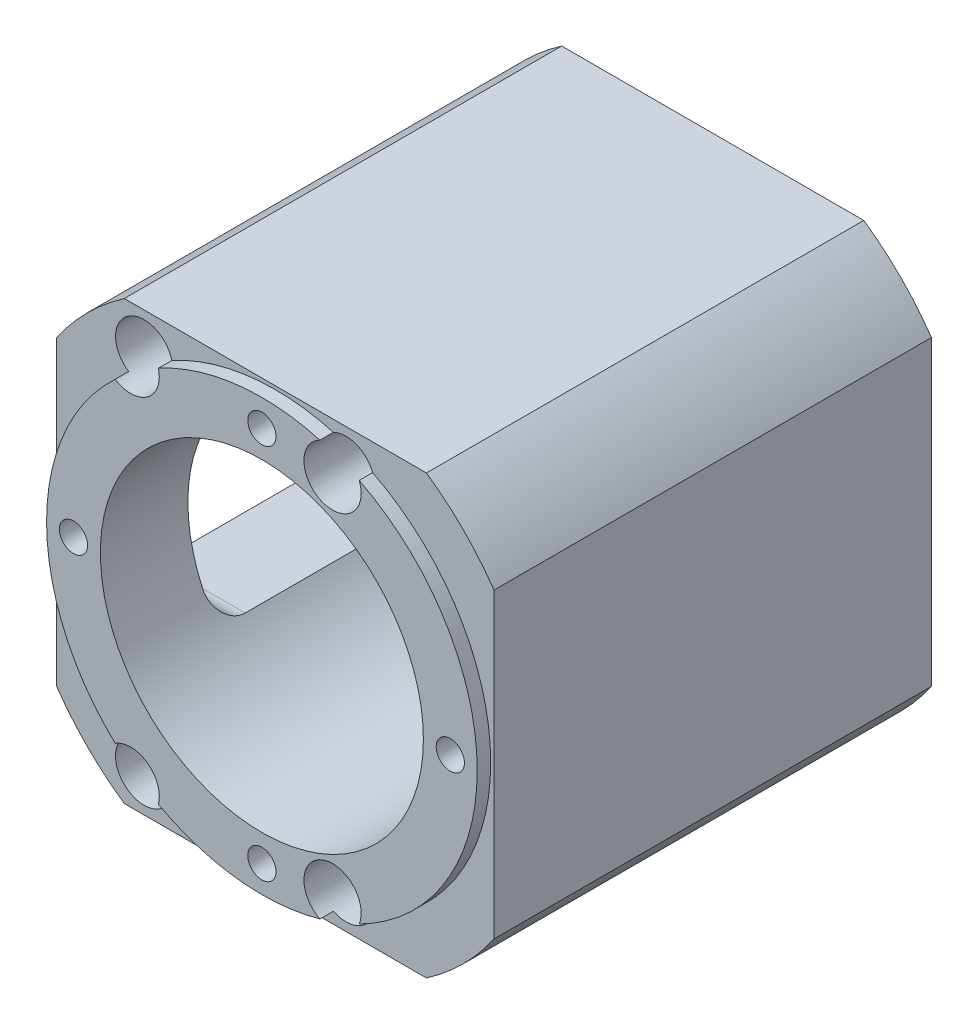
ISO-10303-21;
HEADER;
FILE_DESCRIPTION(('STEP AP214'),'2;1');
FILE_NAME('part.step','',(''),(''),'','','');
FILE_SCHEMA(('AUTOMOTIVE_DESIGN { 1 0 10303 214 1 1 1 1 }'));
ENDSEC;
DATA;
#1=APPLICATION_CONTEXT('core data for automotive mechanical design processes');
#2=APPLICATION_PROTOCOL_DEFINITION('international standard','automotive_design',2000,#1);
#3=PRODUCT_CONTEXT('',#1,'mechanical');
#4=PRODUCT('Part','Part','',(#3));
#5=PRODUCT_RELATED_PRODUCT_CATEGORY('part','',(#4));
#6=PRODUCT_DEFINITION_FORMATION('','',#4);
#7=PRODUCT_DEFINITION_CONTEXT('part definition',#1,'design');
#8=PRODUCT_DEFINITION('design','',#6,#7);
#9=PRODUCT_DEFINITION_SHAPE('','',#8);
#10=(LENGTH_UNIT() NAMED_UNIT(*) SI_UNIT(.MILLI.,.METRE.));
#11=(NAMED_UNIT(*) PLANE_ANGLE_UNIT() SI_UNIT($,.RADIAN.));
#12=(NAMED_UNIT(*) SI_UNIT($,.STERADIAN.) SOLID_ANGLE_UNIT());
#13=UNCERTAINTY_MEASURE_WITH_UNIT(LENGTH_MEASURE(1.E-05),#10,'distance_accuracy_value','');
#14=(GEOMETRIC_REPRESENTATION_CONTEXT(3) GLOBAL_UNCERTAINTY_ASSIGNED_CONTEXT((#13)) GLOBAL_UNIT_ASSIGNED_CONTEXT((#10,
#11,#12)) REPRESENTATION_CONTEXT('',''));
#15=CARTESIAN_POINT('',(0.,0.,0.));
#16=DIRECTION('',(0.,0.,1.));
#17=DIRECTION('',(1.,0.,0.));
#18=AXIS2_PLACEMENT_3D('',#15,#16,#17);
#19=CARTESIAN_POINT('',(0.,0.,65.));
#20=DIRECTION('',(0.,0.,1.));
#21=DIRECTION('',(1.,0.,0.));
#22=AXIS2_PLACEMENT_3D('',#19,#20,#21);
#23=CYLINDRICAL_SURFACE('',#22,32.);
#24=DIRECTION('',(0.,0.,1.));
#25=VECTOR('',#24,1.);
#26=CARTESIAN_POINT('',(14.4582565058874,28.5474835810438,46.));
#27=LINE('',#26,#25);
#28=CARTESIAN_POINT('',(14.4582565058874,28.5474835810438,67.));
#29=VERTEX_POINT('',#28);
#30=CARTESIAN_POINT('',(14.4582565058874,28.5474835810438,65.));
#31=VERTEX_POINT('',#30);
#32=EDGE_CURVE('E484',#29,#31,#27,.F.);
#33=ORIENTED_EDGE('',*,*,#32,.F.);
#34=CARTESIAN_POINT('',(0.,0.,67.));
#35=DIRECTION('',(0.,0.,1.));
#36=DIRECTION('',(1.,0.,0.));
#37=AXIS2_PLACEMENT_3D('',#34,#35,#36);
#38=CIRCLE('',#37,32.);
#39=CARTESIAN_POINT('',(14.4582565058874,-28.5474835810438,67.));
#40=VERTEX_POINT('',#39);
#41=EDGE_CURVE('E339',#29,#40,#38,.F.);
#42=ORIENTED_EDGE('',*,*,#41,.T.);
#43=DIRECTION('',(0.,0.,1.));
#44=VECTOR('',#43,1.);
#45=CARTESIAN_POINT('',(14.4582565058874,-28.5474835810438,46.));
#46=LINE('',#45,#44);
#47=CARTESIAN_POINT('',(14.4582565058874,-28.5474835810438,65.));
#48=VERTEX_POINT('',#47);
#49=EDGE_CURVE('E11',#48,#40,#46,.T.);
#50=ORIENTED_EDGE('',*,*,#49,.F.);
#51=CARTESIAN_POINT('',(0.,0.,65.));
#52=DIRECTION('',(0.,0.,1.));
#53=DIRECTION('',(1.,0.,0.));
#54=AXIS2_PLACEMENT_3D('',#51,#52,#53);
#55=CIRCLE('',#54,32.);
#56=EDGE_CURVE('E415',#48,#31,#55,.T.);
#57=ORIENTED_EDGE('',*,*,#56,.T.);
#58=EDGE_LOOP('',(#33,#42,#50,#57));
#59=FACE_BOUND('',#58,.T.);
#60=ADVANCED_FACE('F40',(#59),#23,.T.);
#61=DIRECTION('',(0.,0.,1.));
#62=VECTOR('',#61,1.);
#63=CARTESIAN_POINT('',(-15.3841472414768,28.0593658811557,46.));
#64=LINE('',#63,#62);
#65=CARTESIAN_POINT('',(-15.3841472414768,28.0593658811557,67.));
#66=VERTEX_POINT('',#65);
#67=CARTESIAN_POINT('',(-15.3841472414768,28.0593658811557,65.));
#68=VERTEX_POINT('',#67);
#69=EDGE_CURVE('E479',#66,#68,#64,.F.);
#70=ORIENTED_EDGE('',*,*,#69,.F.);
#71=CARTESIAN_POINT('',(0.,0.,67.));
#72=DIRECTION('',(0.,0.,1.));
#73=DIRECTION('',(1.,0.,0.));
#74=AXIS2_PLACEMENT_3D('',#71,#72,#73);
#75=CIRCLE('',#74,32.);
#76=CARTESIAN_POINT('',(8.62719925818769,30.8151169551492,67.));
#77=VERTEX_POINT('',#76);
#78=EDGE_CURVE('E349',#66,#77,#75,.F.);
#79=ORIENTED_EDGE('',*,*,#78,.T.);
#80=DIRECTION('',(0.,0.,1.));
#81=VECTOR('',#80,1.);
#82=CARTESIAN_POINT('',(8.62719925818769,30.8151169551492,46.));
#83=LINE('',#82,#81);
#84=CARTESIAN_POINT('',(8.6271992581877,30.8151169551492,65.));
#85=VERTEX_POINT('',#84);
#86=EDGE_CURVE('E486',#85,#77,#83,.T.);
#87=ORIENTED_EDGE('',*,*,#86,.F.);
#88=EDGE_CURVE('E563',#85,#68,#55,.T.);
#89=ORIENTED_EDGE('',*,*,#88,.T.);
#90=EDGE_LOOP('',(#70,#79,#87,#89));
#91=FACE_BOUND('',#90,.T.);
#92=ADVANCED_FACE('F514',(#91),#23,.T.);
#93=DIRECTION('',(0.,0.,1.));
#94=VECTOR('',#93,1.);
#95=CARTESIAN_POINT('',(-21.799676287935,-23.4259282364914,46.));
#96=LINE('',#95,#94);
#97=CARTESIAN_POINT('',(-21.799676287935,-23.4259282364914,67.));
#98=VERTEX_POINT('',#97);
#99=CARTESIAN_POINT('',(-21.799676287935,-23.4259282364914,65.));
#100=VERTEX_POINT('',#99);
#101=EDGE_CURVE('E474',#98,#100,#96,.F.);
#102=ORIENTED_EDGE('',*,*,#101,.F.);
#103=CARTESIAN_POINT('',(0.,0.,67.));
#104=DIRECTION('',(0.,0.,1.));
#105=DIRECTION('',(1.,0.,0.));
#106=AXIS2_PLACEMENT_3D('',#103,#104,#105);
#107=CIRCLE('',#106,32.);
#108=CARTESIAN_POINT('',(-21.799676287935,23.4259282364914,67.));
#109=VERTEX_POINT('',#108);
#110=EDGE_CURVE('E346',#98,#109,#107,.F.);
#111=ORIENTED_EDGE('',*,*,#110,.T.);
#112=DIRECTION('',(0.,0.,1.));
#113=VECTOR('',#112,1.);
#114=CARTESIAN_POINT('',(-21.799676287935,23.4259282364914,46.));
#115=LINE('',#114,#113);
#116=CARTESIAN_POINT('',(-21.799676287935,23.4259282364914,65.));
#117=VERTEX_POINT('',#116);
#118=EDGE_CURVE('E481',#117,#109,#115,.T.);
#119=ORIENTED_EDGE('',*,*,#118,.F.);
#120=EDGE_CURVE('E410',#117,#100,#55,.T.);
#121=ORIENTED_EDGE('',*,*,#120,.T.);
#122=EDGE_LOOP('',(#102,#111,#119,#121));
#123=FACE_BOUND('',#122,.T.);
#124=ADVANCED_FACE('F521',(#123),#23,.T.);
#125=CARTESIAN_POINT('',(0.,0.,69.));
#126=DIRECTION('',(0.,0.,-1.));
#127=DIRECTION('',(-1.,0.,0.));
#128=AXIS2_PLACEMENT_3D('',#125,#126,#127);
#129=CYLINDRICAL_SURFACE('',#128,24.);
#130=CARTESIAN_POINT('',(-19.4935886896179,14.,50.));
#131=CARTESIAN_POINT('',(-19.4935678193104,14.0000201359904,50.0988830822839));
#132=CARTESIAN_POINT('',(-19.4962214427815,13.9963339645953,50.1977511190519));
#133=CARTESIAN_POINT('',(-19.5067188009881,13.9817047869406,50.3946150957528));
#134=CARTESIAN_POINT('',(-19.5145594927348,13.9707660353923,50.4926115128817));
#135=CARTESIAN_POINT('',(-19.5352072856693,13.9418783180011,50.6863963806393));
#136=CARTESIAN_POINT('',(-19.5479828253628,13.9239738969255,50.7821948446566));
#137=CARTESIAN_POINT('',(-19.5782092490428,13.8814409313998,50.9715153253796));
#138=CARTESIAN_POINT('',(-19.5956606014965,13.8568117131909,51.0650371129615));
#139=CARTESIAN_POINT('',(-19.654440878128,13.7734382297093,51.3408644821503));
#140=CARTESIAN_POINT('',(-19.7022606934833,13.7051193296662,51.5190106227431));
#141=CARTESIAN_POINT('',(-19.8119523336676,13.5460635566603,51.860389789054));
#142=CARTESIAN_POINT('',(-19.873845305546,13.4552929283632,52.0235998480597));
#143=CARTESIAN_POINT('',(-20.0139301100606,13.2461202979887,52.3457587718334));
#144=CARTESIAN_POINT('',(-20.0930519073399,13.1260428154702,52.5032110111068));
#145=CARTESIAN_POINT('',(-20.2599762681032,12.866900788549,52.7962820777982));
#146=CARTESIAN_POINT('',(-20.3477820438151,12.727829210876,52.9318927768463));
#147=CARTESIAN_POINT('',(-20.5448380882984,12.4076941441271,53.2022379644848));
#148=CARTESIAN_POINT('',(-20.6551336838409,12.2235546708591,53.3325714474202));
#149=CARTESIAN_POINT('',(-20.8788423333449,11.8373853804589,53.5600888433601));
#150=CARTESIAN_POINT('',(-20.9922568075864,11.6353473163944,53.6572573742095));
#151=CARTESIAN_POINT('',(-21.1663271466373,11.3138473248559,53.7799986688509));
#152=CARTESIAN_POINT('',(-21.2272710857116,11.1991163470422,53.8179506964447));
#153=CARTESIAN_POINT('',(-21.3484661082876,10.9663207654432,53.8834051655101));
#154=CARTESIAN_POINT('',(-21.408717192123,10.8482561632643,53.9109076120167));
#155=CARTESIAN_POINT('',(-21.528037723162,10.6094948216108,53.9551563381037));
#156=CARTESIAN_POINT('',(-21.5871067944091,10.4887972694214,53.9718992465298));
#157=CARTESIAN_POINT('',(-21.7036085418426,10.2455695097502,53.9943235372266));
#158=CARTESIAN_POINT('',(-21.7610408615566,10.1230389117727,54.0000025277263));
#159=CARTESIAN_POINT('',(-21.8174242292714,10.,54.));
#160=B_SPLINE_CURVE_WITH_KNOTS('',3,(#130,#131,#132,#133,#134,#135,#136,#137,#138,#139,#140,
#141,#142,#143,#144,#145,#146,#147,#148,#149,#150,#151,#152,#153,#154,#155,#156,#157,#158,#159),
.UNSPECIFIED.,.F.,.F.,(4,2,2,2,2,2,2,2,2,2,2,2,2,2,4),(0.,0.296520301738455,0.592866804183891,
0.887348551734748,1.18185981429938,1.76913843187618,2.35730542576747,2.99463798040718,
3.63220717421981,4.3825917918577,5.13332397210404,5.53897593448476,5.94462770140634,
6.35040650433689,6.75627301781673),.UNSPECIFIED.);
#161=CARTESIAN_POINT('',(-19.4935886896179,14.,50.));
#162=VERTEX_POINT('',#161);
#163=CARTESIAN_POINT('',(-21.8174242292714,10.,54.));
#164=VERTEX_POINT('',#163);
#165=EDGE_CURVE('E300',#162,#164,#160,.T.);
#166=ORIENTED_EDGE('',*,*,#165,.F.);
#167=DIRECTION('',(0.,0.,-1.));
#168=VECTOR('',#167,1.);
#169=CARTESIAN_POINT('',(-19.4935886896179,14.,69.));
#170=LINE('',#169,#168);
#171=CARTESIAN_POINT('',(-19.4935886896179,14.,13.));
#172=VERTEX_POINT('',#171);
#173=EDGE_CURVE('E269',#172,#162,#170,.F.);
#174=ORIENTED_EDGE('',*,*,#173,.F.);
#175=CARTESIAN_POINT('',(-21.8174242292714,10.,9.00000000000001));
#176=CARTESIAN_POINT('',(-21.7595732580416,10.1262429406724,8.99999808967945));
#177=CARTESIAN_POINT('',(-21.7006188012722,10.2519472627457,9.00597618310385));
#178=CARTESIAN_POINT('',(-21.5810037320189,10.5013934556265,9.02957294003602));
#179=CARTESIAN_POINT('',(-21.5203436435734,10.625135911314,9.04718806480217));
#180=CARTESIAN_POINT('',(-21.3978174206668,10.8697809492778,9.09372651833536));
#181=CARTESIAN_POINT('',(-21.3359519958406,10.990685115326,9.12264337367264));
#182=CARTESIAN_POINT('',(-21.2115392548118,11.2289230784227,9.19143836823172));
#183=CARTESIAN_POINT('',(-21.1489918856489,11.3462565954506,9.23131736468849));
#184=CARTESIAN_POINT('',(-20.9612216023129,11.6916828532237,9.36692098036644));
#185=CARTESIAN_POINT('',(-20.8356541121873,11.9136309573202,9.47869493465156));
#186=CARTESIAN_POINT('',(-20.6508446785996,12.2293781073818,9.67654291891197));
#187=CARTESIAN_POINT('',(-20.5897775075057,12.3318506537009,9.74760241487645));
#188=CARTESIAN_POINT('',(-20.4695472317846,12.5304069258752,9.89956741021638));
#189=CARTESIAN_POINT('',(-20.4103842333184,12.6264902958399,9.98047345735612));
#190=CARTESIAN_POINT('',(-20.2365363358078,12.9046599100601,10.2383201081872));
#191=CARTESIAN_POINT('',(-20.1258101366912,13.0761288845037,10.4300561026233));
#192=CARTESIAN_POINT('',(-19.9741696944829,13.3056786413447,10.7440465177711));
#193=CARTESIAN_POINT('',(-19.9260443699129,13.3775673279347,10.8530678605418));
#194=CARTESIAN_POINT('',(-19.8356691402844,13.5112061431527,11.0794021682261));
#195=CARTESIAN_POINT('',(-19.7934163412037,13.5729612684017,11.1967110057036));
#196=CARTESIAN_POINT('',(-19.7001831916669,13.7081018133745,11.4883208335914));
#197=CARTESIAN_POINT('',(-19.6526488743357,13.775992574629,11.6663870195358));
#198=CARTESIAN_POINT('',(-19.5943756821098,13.8586276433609,11.9416069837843));
#199=CARTESIAN_POINT('',(-19.5771289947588,13.8829637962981,12.0346432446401));
#200=CARTESIAN_POINT('',(-19.5472670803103,13.924978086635,12.2229321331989));
#201=CARTESIAN_POINT('',(-19.5346501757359,13.9426586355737,12.3181839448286));
#202=CARTESIAN_POINT('',(-19.5142701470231,13.9711698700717,12.5107829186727));
#203=CARTESIAN_POINT('',(-19.5065351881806,13.9819608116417,12.6081389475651));
#204=CARTESIAN_POINT('',(-19.4961840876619,13.9963859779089,12.8036582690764));
#205=CARTESIAN_POINT('',(-19.4935684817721,14.0000194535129,12.901821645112));
#206=CARTESIAN_POINT('',(-19.4935886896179,14.,13.));
#207=B_SPLINE_CURVE_WITH_KNOTS('',3,(#175,#176,#177,#178,#179,#180,#181,#182,#183,#184,#185,
#186,#187,#188,#189,#190,#191,#192,#193,#194,#195,#196,#197,#198,#199,#200,#201,#202,#203,#204,
#205,#206),.UNSPECIFIED.,.F.,.F.,(4,2,2,2,2,2,2,2,2,2,2,2,2,2,2,4),(0.,0.416420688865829,
0.832714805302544,1.24877082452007,1.6648593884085,2.49558893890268,2.91171700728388,
3.32786823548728,4.16226524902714,4.57919180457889,4.9959121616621,5.58222167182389,
5.87503175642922,6.16773564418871,6.46211314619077,6.75652145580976),.UNSPECIFIED.);
#208=CARTESIAN_POINT('',(-21.8174242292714,10.,9.00000000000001));
#209=VERTEX_POINT('',#208);
#210=EDGE_CURVE('E224',#209,#172,#207,.T.);
#211=ORIENTED_EDGE('',*,*,#210,.F.);
#212=CARTESIAN_POINT('',(0.,0.,9.00000000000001));
#213=DIRECTION('',(0.,0.,-1.));
#214=DIRECTION('',(0.,1.,0.));
#215=AXIS2_PLACEMENT_3D('',#212,#213,#214);
#216=CIRCLE('',#215,24.);
#217=CARTESIAN_POINT('',(-21.8174242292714,-9.99999999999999,9.00000000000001));
#218=VERTEX_POINT('',#217);
#219=EDGE_CURVE('E277',#218,#209,#216,.T.);
#220=ORIENTED_EDGE('',*,*,#219,.F.);
#221=CARTESIAN_POINT('',(-19.4935886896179,-14.,13.));
#222=CARTESIAN_POINT('',(-19.4935678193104,-14.0000201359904,12.9011169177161));
#223=CARTESIAN_POINT('',(-19.4962214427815,-13.9963339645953,12.8022488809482));
#224=CARTESIAN_POINT('',(-19.5067188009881,-13.9817047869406,12.6053849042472));
#225=CARTESIAN_POINT('',(-19.5145594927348,-13.9707660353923,12.5073884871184));
#226=CARTESIAN_POINT('',(-19.5352072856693,-13.941878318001,12.3136036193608));
#227=CARTESIAN_POINT('',(-19.5479828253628,-13.9239738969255,12.2178051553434));
#228=CARTESIAN_POINT('',(-19.5782092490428,-13.8814409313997,12.0284846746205));
#229=CARTESIAN_POINT('',(-19.5956606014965,-13.8568117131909,11.9349628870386));
#230=CARTESIAN_POINT('',(-19.654440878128,-13.7734382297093,11.6591355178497));
#231=CARTESIAN_POINT('',(-19.7022606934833,-13.7051193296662,11.4809893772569));
#232=CARTESIAN_POINT('',(-19.8119523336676,-13.5460635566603,11.139610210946));
#233=CARTESIAN_POINT('',(-19.873845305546,-13.4552929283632,10.9764001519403));
#234=CARTESIAN_POINT('',(-20.0139301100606,-13.2461202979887,10.6542412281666));
#235=CARTESIAN_POINT('',(-20.0930519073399,-13.1260428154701,10.4967889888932));
#236=CARTESIAN_POINT('',(-20.2599762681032,-12.866900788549,10.2037179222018));
#237=CARTESIAN_POINT('',(-20.3477820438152,-12.7278292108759,10.0681072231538));
#238=CARTESIAN_POINT('',(-20.5448380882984,-12.4076941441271,9.79776203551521));
#239=CARTESIAN_POINT('',(-20.6551336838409,-12.2235546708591,9.66742855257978));
#240=CARTESIAN_POINT('',(-20.878842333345,-11.8373853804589,9.43991115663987));
#241=CARTESIAN_POINT('',(-20.9922568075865,-11.6353473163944,9.34274262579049));
#242=CARTESIAN_POINT('',(-21.1663271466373,-11.3138473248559,9.2200013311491));
#243=CARTESIAN_POINT('',(-21.2272710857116,-11.1991163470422,9.1820493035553));
#244=CARTESIAN_POINT('',(-21.3484661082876,-10.9663207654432,9.11659483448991));
#245=CARTESIAN_POINT('',(-21.408717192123,-10.8482561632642,9.08909238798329));
#246=CARTESIAN_POINT('',(-21.528037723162,-10.6094948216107,9.04484366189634));
#247=CARTESIAN_POINT('',(-21.5871067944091,-10.4887972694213,9.02810075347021));
#248=CARTESIAN_POINT('',(-21.7036085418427,-10.2455695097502,9.00567646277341));
#249=CARTESIAN_POINT('',(-21.7610408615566,-10.1230389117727,8.99999747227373));
#250=CARTESIAN_POINT('',(-21.8174242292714,-9.99999999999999,9.00000000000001));
#251=B_SPLINE_CURVE_WITH_KNOTS('',3,(#221,#222,#223,#224,#225,#226,#227,#228,#229,#230,#231,
#232,#233,#234,#235,#236,#237,#238,#239,#240,#241,#242,#243,#244,#245,#246,#247,#248,#249,#250),
.UNSPECIFIED.,.F.,.F.,(4,2,2,2,2,2,2,2,2,2,2,2,2,2,4),(0.,0.29652030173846,0.592866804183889,
0.887348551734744,1.18185981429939,1.7691384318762,2.35730542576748,2.9946379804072,
3.63220717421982,4.38259179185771,5.13332397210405,5.53897593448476,5.94462770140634,
6.35040650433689,6.75627301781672),.UNSPECIFIED.);
#252=CARTESIAN_POINT('',(-19.4935886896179,-14.,13.));
#253=VERTEX_POINT('',#252);
#254=EDGE_CURVE('E953',#253,#218,#251,.T.);
#255=ORIENTED_EDGE('',*,*,#254,.F.);
#256=DIRECTION('',(0.,0.,-1.));
#257=VECTOR('',#256,1.);
#258=CARTESIAN_POINT('',(-19.4935886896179,-14.,69.));
#259=LINE('',#258,#257);
#260=CARTESIAN_POINT('',(-19.4935886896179,-14.,50.));
#261=VERTEX_POINT('',#260);
#262=EDGE_CURVE('E962',#261,#253,#259,.T.);
#263=ORIENTED_EDGE('',*,*,#262,.F.);
#264=CARTESIAN_POINT('',(-21.8174242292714,-9.99999999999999,54.));
#265=CARTESIAN_POINT('',(-21.7595732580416,-10.1262429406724,54.0000019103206));
#266=CARTESIAN_POINT('',(-21.7006188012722,-10.2519472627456,53.9940238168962));
#267=CARTESIAN_POINT('',(-21.5810037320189,-10.5013934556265,53.970427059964));
#268=CARTESIAN_POINT('',(-21.5203436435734,-10.625135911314,53.9528119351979));
#269=CARTESIAN_POINT('',(-21.3978174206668,-10.8697809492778,53.9062734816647));
#270=CARTESIAN_POINT('',(-21.3359519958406,-10.990685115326,53.8773566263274));
#271=CARTESIAN_POINT('',(-21.2115392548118,-11.2289230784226,53.8085616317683));
#272=CARTESIAN_POINT('',(-21.1489918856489,-11.3462565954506,53.7686826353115));
#273=CARTESIAN_POINT('',(-20.961221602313,-11.6916828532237,53.6330790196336));
#274=CARTESIAN_POINT('',(-20.8356541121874,-11.9136309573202,53.5213050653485));
#275=CARTESIAN_POINT('',(-20.6508446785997,-12.2293781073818,53.3234570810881));
#276=CARTESIAN_POINT('',(-20.5897775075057,-12.3318506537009,53.2523975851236));
#277=CARTESIAN_POINT('',(-20.4695472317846,-12.5304069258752,53.1004325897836));
#278=CARTESIAN_POINT('',(-20.4103842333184,-12.6264902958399,53.0195265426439));
#279=CARTESIAN_POINT('',(-20.2365363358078,-12.9046599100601,52.7616798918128));
#280=CARTESIAN_POINT('',(-20.1258101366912,-13.0761288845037,52.5699438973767));
#281=CARTESIAN_POINT('',(-19.9741696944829,-13.3056786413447,52.255953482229));
#282=CARTESIAN_POINT('',(-19.9260443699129,-13.3775673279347,52.1469321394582));
#283=CARTESIAN_POINT('',(-19.8356691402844,-13.5112061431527,51.9205978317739));
#284=CARTESIAN_POINT('',(-19.7934163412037,-13.5729612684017,51.8032889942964));
#285=CARTESIAN_POINT('',(-19.7001831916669,-13.7081018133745,51.5116791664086));
#286=CARTESIAN_POINT('',(-19.6526488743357,-13.775992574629,51.3336129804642));
#287=CARTESIAN_POINT('',(-19.5943756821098,-13.8586276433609,51.0583930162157));
#288=CARTESIAN_POINT('',(-19.5771289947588,-13.8829637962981,50.9653567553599));
#289=CARTESIAN_POINT('',(-19.5472670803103,-13.924978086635,50.7770678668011));
#290=CARTESIAN_POINT('',(-19.5346501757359,-13.9426586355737,50.6818160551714));
#291=CARTESIAN_POINT('',(-19.5142701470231,-13.9711698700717,50.4892170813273));
#292=CARTESIAN_POINT('',(-19.5065351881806,-13.9819608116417,50.3918610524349));
#293=CARTESIAN_POINT('',(-19.4961840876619,-13.9963859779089,50.1963417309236));
#294=CARTESIAN_POINT('',(-19.4935684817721,-14.0000194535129,50.098178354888));
#295=CARTESIAN_POINT('',(-19.4935886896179,-14.,50.));
#296=B_SPLINE_CURVE_WITH_KNOTS('',3,(#264,#265,#266,#267,#268,#269,#270,#271,#272,#273,#274,
#275,#276,#277,#278,#279,#280,#281,#282,#283,#284,#285,#286,#287,#288,#289,#290,#291,#292,#293,
#294,#295),.UNSPECIFIED.,.F.,.F.,(4,2,2,2,2,2,2,2,2,2,2,2,2,2,2,4),(0.,0.41642068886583,
0.832714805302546,1.24877082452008,1.66485938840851,2.49558893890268,2.91171700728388,
3.32786823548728,4.16226524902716,4.5791918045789,4.99591216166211,5.5822216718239,
5.87503175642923,6.16773564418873,6.46211314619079,6.75652145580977),.UNSPECIFIED.);
#297=CARTESIAN_POINT('',(-21.8174242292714,-9.99999999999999,54.));
#298=VERTEX_POINT('',#297);
#299=EDGE_CURVE('E307',#298,#261,#296,.T.);
#300=ORIENTED_EDGE('',*,*,#299,.F.);
#301=CARTESIAN_POINT('',(0.,0.,54.));
#302=DIRECTION('',(0.,0.,1.));
#303=DIRECTION('',(0.,-1.,0.));
#304=AXIS2_PLACEMENT_3D('',#301,#302,#303);
#305=CIRCLE('',#304,24.);
#306=EDGE_CURVE('E267',#164,#298,#305,.T.);
#307=ORIENTED_EDGE('',*,*,#306,.F.);
#308=EDGE_LOOP('',(#166,#174,#211,#220,#255,#263,#300,#307));
#309=FACE_BOUND('',#308,.T.);
#310=CARTESIAN_POINT('',(0.,0.,0.));
#311=DIRECTION('',(0.,0.,1.));
#312=DIRECTION('',(1.,0.,0.));
#313=AXIS2_PLACEMENT_3D('',#310,#311,#312);
#314=CIRCLE('',#313,24.);
#315=CARTESIAN_POINT('',(24.,0.,0.));
#316=VERTEX_POINT('',#315);
#317=EDGE_CURVE('E429',#316,#316,#314,.T.);
#318=ORIENTED_EDGE('',*,*,#317,.F.);
#319=EDGE_LOOP('',(#318));
#320=FACE_BOUND('',#319,.T.);
#321=CARTESIAN_POINT('',(0.,0.,67.));
#322=DIRECTION('',(0.,0.,1.));
#323=DIRECTION('',(1.,0.,0.));
#324=AXIS2_PLACEMENT_3D('',#321,#322,#323);
#325=CIRCLE('',#324,24.);
#326=CARTESIAN_POINT('',(24.,0.,67.));
#327=VERTEX_POINT('',#326);
#328=EDGE_CURVE('E354',#327,#327,#325,.T.);
#329=ORIENTED_EDGE('',*,*,#328,.T.);
#330=EDGE_LOOP('',(#329));
#331=FACE_BOUND('',#330,.T.);
#332=ADVANCED_FACE('F279',(#309,#320,#331),#129,.F.);
#333=DIRECTION('',(0.,0.,1.));
#334=VECTOR('',#333,1.);
#335=CARTESIAN_POINT('',(8.6271992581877,-30.8151169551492,46.));
#336=LINE('',#335,#334);
#337=CARTESIAN_POINT('',(8.6271992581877,-30.8151169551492,67.));
#338=VERTEX_POINT('',#337);
#339=CARTESIAN_POINT('',(8.62719925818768,-30.8151169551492,65.));
#340=VERTEX_POINT('',#339);
#341=EDGE_CURVE('E49',#338,#340,#336,.F.);
#342=ORIENTED_EDGE('',*,*,#341,.F.);
#343=CARTESIAN_POINT('',(0.,0.,67.));
#344=DIRECTION('',(0.,0.,1.));
#345=DIRECTION('',(1.,0.,0.));
#346=AXIS2_PLACEMENT_3D('',#343,#344,#345);
#347=CIRCLE('',#346,32.);
#348=CARTESIAN_POINT('',(-15.3841472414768,-28.0593658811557,67.));
#349=VERTEX_POINT('',#348);
#350=EDGE_CURVE('E336',#338,#349,#347,.F.);
#351=ORIENTED_EDGE('',*,*,#350,.T.);
#352=DIRECTION('',(0.,0.,1.));
#353=VECTOR('',#352,1.);
#354=CARTESIAN_POINT('',(-15.3841472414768,-28.0593658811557,46.));
#355=LINE('',#354,#353);
#356=CARTESIAN_POINT('',(-15.3841472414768,-28.0593658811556,65.));
#357=VERTEX_POINT('',#356);
#358=EDGE_CURVE('E476',#357,#349,#355,.T.);
#359=ORIENTED_EDGE('',*,*,#358,.F.);
#360=EDGE_CURVE('E411',#357,#340,#55,.T.);
#361=ORIENTED_EDGE('',*,*,#360,.T.);
#362=EDGE_LOOP('',(#342,#351,#359,#361));
#363=FACE_BOUND('',#362,.T.);
#364=ADVANCED_FACE('F517',(#363),#23,.T.);
#365=CARTESIAN_POINT('',(-19.5,-27.,69.));
#366=DIRECTION('',(0.,0.,1.));
#367=DIRECTION('',(1.,0.,0.));
#368=AXIS2_PLACEMENT_3D('',#365,#366,#367);
#369=CYLINDRICAL_SURFACE('',#368,4.24999999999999);
#370=CARTESIAN_POINT('',(-19.5,-27.,23.));
#371=DIRECTION('',(0.,0.,1.));
#372=DIRECTION('',(1.,0.,0.));
#373=AXIS2_PLACEMENT_3D('',#370,#371,#372);
#374=CIRCLE('',#373,4.24999999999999);
#375=CARTESIAN_POINT('',(-15.25,-27.,23.));
#376=VERTEX_POINT('',#375);
#377=EDGE_CURVE('E399',#376,#376,#374,.T.);
#378=ORIENTED_EDGE('',*,*,#377,.F.);
#379=EDGE_LOOP('',(#378));
#380=FACE_BOUND('',#379,.T.);
#381=CARTESIAN_POINT('',(-19.5,-27.,67.));
#382=DIRECTION('',(0.,0.,1.));
#383=DIRECTION('',(1.,0.,0.));
#384=AXIS2_PLACEMENT_3D('',#381,#382,#383);
#385=CIRCLE('',#384,4.24999999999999);
#386=EDGE_CURVE('E344',#98,#349,#385,.F.);
#387=ORIENTED_EDGE('',*,*,#386,.F.);
#388=ORIENTED_EDGE('',*,*,#101,.T.);
#389=CARTESIAN_POINT('',(-19.5,-27.,65.));
#390=DIRECTION('',(0.,0.,1.));
#391=DIRECTION('',(1.,0.,0.));
#392=AXIS2_PLACEMENT_3D('',#389,#390,#391);
#393=CIRCLE('',#392,4.24999999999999);
#394=EDGE_CURVE('E408',#100,#357,#393,.T.);
#395=ORIENTED_EDGE('',*,*,#394,.T.);
#396=ORIENTED_EDGE('',*,*,#358,.T.);
#397=EDGE_LOOP('',(#387,#388,#395,#396));
#398=FACE_BOUND('',#397,.T.);
#399=ADVANCED_FACE('F526',(#380,#398),#369,.F.);
#400=CARTESIAN_POINT('',(-19.5,27.,69.));
#401=DIRECTION('',(0.,0.,1.));
#402=DIRECTION('',(1.,0.,0.));
#403=AXIS2_PLACEMENT_3D('',#400,#401,#402);
#404=CYLINDRICAL_SURFACE('',#403,4.24999999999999);
#405=CARTESIAN_POINT('',(-19.5,27.,23.));
#406=DIRECTION('',(0.,0.,1.));
#407=DIRECTION('',(1.,0.,0.));
#408=AXIS2_PLACEMENT_3D('',#405,#406,#407);
#409=CIRCLE('',#408,4.24999999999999);
#410=CARTESIAN_POINT('',(-15.25,27.,23.));
#411=VERTEX_POINT('',#410);
#412=EDGE_CURVE('E388',#411,#411,#409,.T.);
#413=ORIENTED_EDGE('',*,*,#412,.F.);
#414=EDGE_LOOP('',(#413));
#415=FACE_BOUND('',#414,.T.);
#416=CARTESIAN_POINT('',(-19.5,27.,67.));
#417=DIRECTION('',(0.,0.,1.));
#418=DIRECTION('',(1.,0.,0.));
#419=AXIS2_PLACEMENT_3D('',#416,#417,#418);
#420=CIRCLE('',#419,4.24999999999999);
#421=EDGE_CURVE('E352',#66,#109,#420,.F.);
#422=ORIENTED_EDGE('',*,*,#421,.F.);
#423=ORIENTED_EDGE('',*,*,#69,.T.);
#424=CARTESIAN_POINT('',(-19.5,27.,65.));
#425=DIRECTION('',(0.,0.,1.));
#426=DIRECTION('',(1.,0.,0.));
#427=AXIS2_PLACEMENT_3D('',#424,#425,#426);
#428=CIRCLE('',#427,4.24999999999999);
#429=EDGE_CURVE('E397',#68,#117,#428,.T.);
#430=ORIENTED_EDGE('',*,*,#429,.T.);
#431=ORIENTED_EDGE('',*,*,#118,.T.);
#432=EDGE_LOOP('',(#422,#423,#430,#431));
#433=FACE_BOUND('',#432,.T.);
#434=ADVANCED_FACE('F532',(#415,#433),#404,.F.);
#435=CARTESIAN_POINT('',(10.5,27.,69.));
#436=DIRECTION('',(0.,0.,1.));
#437=DIRECTION('',(1.,0.,0.));
#438=AXIS2_PLACEMENT_3D('',#435,#436,#437);
#439=CYLINDRICAL_SURFACE('',#438,4.24999999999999);
#440=CARTESIAN_POINT('',(10.5,27.,23.));
#441=DIRECTION('',(0.,0.,1.));
#442=DIRECTION('',(1.,0.,0.));
#443=AXIS2_PLACEMENT_3D('',#440,#441,#442);
#444=CIRCLE('',#443,4.24999999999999);
#445=CARTESIAN_POINT('',(14.75,27.,23.));
#446=VERTEX_POINT('',#445);
#447=EDGE_CURVE('E377',#446,#446,#444,.T.);
#448=ORIENTED_EDGE('',*,*,#447,.F.);
#449=EDGE_LOOP('',(#448));
#450=FACE_BOUND('',#449,.T.);
#451=CARTESIAN_POINT('',(10.5,27.,67.));
#452=DIRECTION('',(0.,0.,1.));
#453=DIRECTION('',(1.,0.,0.));
#454=AXIS2_PLACEMENT_3D('',#451,#452,#453);
#455=CIRCLE('',#454,4.24999999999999);
#456=EDGE_CURVE('E342',#29,#77,#455,.F.);
#457=ORIENTED_EDGE('',*,*,#456,.F.);
#458=ORIENTED_EDGE('',*,*,#32,.T.);
#459=CARTESIAN_POINT('',(10.5,27.,65.));
#460=DIRECTION('',(0.,0.,1.));
#461=DIRECTION('',(1.,0.,0.));
#462=AXIS2_PLACEMENT_3D('',#459,#460,#461);
#463=CIRCLE('',#462,4.24999999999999);
#464=EDGE_CURVE('E386',#31,#85,#463,.T.);
#465=ORIENTED_EDGE('',*,*,#464,.T.);
#466=ORIENTED_EDGE('',*,*,#86,.T.);
#467=EDGE_LOOP('',(#457,#458,#465,#466));
#468=FACE_BOUND('',#467,.T.);
#469=ADVANCED_FACE('F572',(#450,#468),#439,.F.);
#470=CARTESIAN_POINT('',(10.5,-27.,69.));
#471=DIRECTION('',(0.,0.,1.));
#472=DIRECTION('',(1.,0.,0.));
#473=AXIS2_PLACEMENT_3D('',#470,#471,#472);
#474=CYLINDRICAL_SURFACE('',#473,4.24999999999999);
#475=CARTESIAN_POINT('',(10.5,-27.,23.));
#476=DIRECTION('',(0.,0.,1.));
#477=DIRECTION('',(1.,0.,0.));
#478=AXIS2_PLACEMENT_3D('',#475,#476,#477);
#479=CIRCLE('',#478,4.24999999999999);
#480=CARTESIAN_POINT('',(14.75,-27.,23.));
#481=VERTEX_POINT('',#480);
#482=EDGE_CURVE('E366',#481,#481,#479,.T.);
#483=ORIENTED_EDGE('',*,*,#482,.F.);
#484=EDGE_LOOP('',(#483));
#485=FACE_BOUND('',#484,.T.);
#486=CARTESIAN_POINT('',(10.5,-27.,67.));
#487=DIRECTION('',(0.,0.,1.));
#488=DIRECTION('',(1.,0.,0.));
#489=AXIS2_PLACEMENT_3D('',#486,#487,#488);
#490=CIRCLE('',#489,4.24999999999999);
#491=EDGE_CURVE('E334',#338,#40,#490,.F.);
#492=ORIENTED_EDGE('',*,*,#491,.F.);
#493=ORIENTED_EDGE('',*,*,#341,.T.);
#494=CARTESIAN_POINT('',(10.5,-27.,65.));
#495=DIRECTION('',(0.,0.,1.));
#496=DIRECTION('',(1.,0.,0.));
#497=AXIS2_PLACEMENT_3D('',#494,#495,#496);
#498=CIRCLE('',#497,4.24999999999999);
#499=EDGE_CURVE('E375',#340,#48,#498,.T.);
#500=ORIENTED_EDGE('',*,*,#499,.T.);
#501=ORIENTED_EDGE('',*,*,#49,.T.);
#502=EDGE_LOOP('',(#492,#493,#500,#501));
#503=FACE_BOUND('',#502,.T.);
#504=ADVANCED_FACE('F554',(#485,#503),#474,.F.);
#505=CARTESIAN_POINT('',(0.,0.,69.));
#506=DIRECTION('',(0.,0.,-1.));
#507=DIRECTION('',(-1.,0.,0.));
#508=AXIS2_PLACEMENT_3D('',#505,#506,#507);
#509=CYLINDRICAL_SURFACE('',#508,39.5);
#510=CARTESIAN_POINT('',(0.,0.,65.));
#511=DIRECTION('',(0.,0.,1.));
#512=DIRECTION('',(1.,0.,0.));
#513=AXIS2_PLACEMENT_3D('',#510,#511,#512);
#514=CIRCLE('',#513,39.5);
#515=CARTESIAN_POINT('',(22.4499443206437,-32.5,65.));
#516=VERTEX_POINT('',#515);
#517=CARTESIAN_POINT('',(32.5,-22.4499443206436,65.));
#518=VERTEX_POINT('',#517);
#519=EDGE_CURVE('E427',#516,#518,#514,.T.);
#520=ORIENTED_EDGE('',*,*,#519,.F.);
#521=DIRECTION('',(0.,0.,-1.));
#522=VECTOR('',#521,1.);
#523=CARTESIAN_POINT('',(22.4499443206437,-32.5,69.));
#524=LINE('',#523,#522);
#525=CARTESIAN_POINT('',(22.4499443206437,-32.5,0.));
#526=VERTEX_POINT('',#525);
#527=EDGE_CURVE('E456',#516,#526,#524,.T.);
#528=ORIENTED_EDGE('',*,*,#527,.T.);
#529=CARTESIAN_POINT('',(0.,0.,0.));
#530=DIRECTION('',(0.,0.,1.));
#531=DIRECTION('',(1.,0.,0.));
#532=AXIS2_PLACEMENT_3D('',#529,#530,#531);
#533=CIRCLE('',#532,39.5);
#534=CARTESIAN_POINT('',(32.5,-22.4499443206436,0.));
#535=VERTEX_POINT('',#534);
#536=EDGE_CURVE('E432',#526,#535,#533,.T.);
#537=ORIENTED_EDGE('',*,*,#536,.T.);
#538=DIRECTION('',(0.,0.,-1.));
#539=VECTOR('',#538,1.);
#540=CARTESIAN_POINT('',(32.5,-22.4499443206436,69.));
#541=LINE('',#540,#539);
#542=EDGE_CURVE('E470',#518,#535,#541,.T.);
#543=ORIENTED_EDGE('',*,*,#542,.F.);
#544=EDGE_LOOP('',(#520,#528,#537,#543));
#545=FACE_BOUND('',#544,.T.);
#546=ADVANCED_FACE('F42',(#545),#509,.T.);
#547=CARTESIAN_POINT('',(32.5,22.4499443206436,69.));
#548=DIRECTION('',(-1.,0.,0.));
#549=DIRECTION('',(0.,-1.,0.));
#550=AXIS2_PLACEMENT_3D('',#547,#548,#549);
#551=PLANE('',#550);
#552=DIRECTION('',(0.,1.,0.));
#553=VECTOR('',#552,1.);
#554=CARTESIAN_POINT('',(32.5,22.4499443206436,65.));
#555=LINE('',#554,#553);
#556=CARTESIAN_POINT('',(32.5,22.4499443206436,65.));
#557=VERTEX_POINT('',#556);
#558=EDGE_CURVE('E425',#518,#557,#555,.T.);
#559=ORIENTED_EDGE('',*,*,#558,.F.);
#560=ORIENTED_EDGE('',*,*,#542,.T.);
#561=DIRECTION('',(0.,1.,0.));
#562=VECTOR('',#561,1.);
#563=CARTESIAN_POINT('',(32.5,22.4499443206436,0.));
#564=LINE('',#563,#562);
#565=CARTESIAN_POINT('',(32.5,22.4499443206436,0.));
#566=VERTEX_POINT('',#565);
#567=EDGE_CURVE('E435',#535,#566,#564,.T.);
#568=ORIENTED_EDGE('',*,*,#567,.T.);
#569=DIRECTION('',(0.,0.,-1.));
#570=VECTOR('',#569,1.);
#571=CARTESIAN_POINT('',(32.5,22.4499443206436,69.));
#572=LINE('',#571,#570);
#573=EDGE_CURVE('E468',#557,#566,#572,.T.);
#574=ORIENTED_EDGE('',*,*,#573,.F.);
#575=EDGE_LOOP('',(#559,#560,#568,#574));
#576=FACE_BOUND('',#575,.T.);
#577=ADVANCED_FACE('F771',(#576),#551,.F.);
#578=CARTESIAN_POINT('',(0.,0.,69.));
#579=DIRECTION('',(0.,0.,-1.));
#580=DIRECTION('',(-1.,0.,0.));
#581=AXIS2_PLACEMENT_3D('',#578,#579,#580);
#582=CYLINDRICAL_SURFACE('',#581,39.5);
#583=CARTESIAN_POINT('',(0.,0.,65.));
#584=DIRECTION('',(0.,0.,1.));
#585=DIRECTION('',(1.,0.,0.));
#586=AXIS2_PLACEMENT_3D('',#583,#584,#585);
#587=CIRCLE('',#586,39.5);
#588=CARTESIAN_POINT('',(22.4499443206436,32.5,65.));
#589=VERTEX_POINT('',#588);
#590=EDGE_CURVE('E423',#557,#589,#587,.T.);
#591=ORIENTED_EDGE('',*,*,#590,.F.);
#592=ORIENTED_EDGE('',*,*,#573,.T.);
#593=CARTESIAN_POINT('',(0.,0.,0.));
#594=DIRECTION('',(0.,0.,1.));
#595=DIRECTION('',(1.,0.,0.));
#596=AXIS2_PLACEMENT_3D('',#593,#594,#595);
#597=CIRCLE('',#596,39.5);
#598=CARTESIAN_POINT('',(22.4499443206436,32.5,0.));
#599=VERTEX_POINT('',#598);
#600=EDGE_CURVE('E438',#566,#599,#597,.T.);
#601=ORIENTED_EDGE('',*,*,#600,.T.);
#602=DIRECTION('',(0.,0.,-1.));
#603=VECTOR('',#602,1.);
#604=CARTESIAN_POINT('',(22.4499443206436,32.5,69.));
#605=LINE('',#604,#603);
#606=EDGE_CURVE('E466',#589,#599,#605,.T.);
#607=ORIENTED_EDGE('',*,*,#606,.F.);
#608=EDGE_LOOP('',(#591,#592,#601,#607));
#609=FACE_BOUND('',#608,.T.);
#610=ADVANCED_FACE('F761',(#609),#582,.T.);
#611=CARTESIAN_POINT('',(22.4499443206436,32.5,69.));
#612=DIRECTION('',(0.,-1.,0.));
#613=DIRECTION('',(0.,0.,-1.));
#614=AXIS2_PLACEMENT_3D('',#611,#612,#613);
#615=PLANE('',#614);
#616=DIRECTION('',(-1.,0.,0.));
#617=VECTOR('',#616,1.);
#618=CARTESIAN_POINT('',(22.4499443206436,32.5,65.));
#619=LINE('',#618,#617);
#620=CARTESIAN_POINT('',(-22.4499443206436,32.5,65.));
#621=VERTEX_POINT('',#620);
#622=EDGE_CURVE('E421',#589,#621,#619,.T.);
#623=ORIENTED_EDGE('',*,*,#622,.F.);
#624=ORIENTED_EDGE('',*,*,#606,.T.);
#625=DIRECTION('',(-1.,0.,0.));
#626=VECTOR('',#625,1.);
#627=CARTESIAN_POINT('',(22.4499443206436,32.5,0.));
#628=LINE('',#627,#626);
#629=CARTESIAN_POINT('',(-22.4499443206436,32.5,0.));
#630=VERTEX_POINT('',#629);
#631=EDGE_CURVE('E441',#599,#630,#628,.T.);
#632=ORIENTED_EDGE('',*,*,#631,.T.);
#633=DIRECTION('',(0.,0.,-1.));
#634=VECTOR('',#633,1.);
#635=CARTESIAN_POINT('',(-22.4499443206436,32.5,69.));
#636=LINE('',#635,#634);
#637=EDGE_CURVE('E464',#621,#630,#636,.T.);
#638=ORIENTED_EDGE('',*,*,#637,.F.);
#639=EDGE_LOOP('',(#623,#624,#632,#638));
#640=FACE_BOUND('',#639,.T.);
#641=ADVANCED_FACE('F751',(#640),#615,.F.);
#642=CARTESIAN_POINT('',(0.,0.,69.));
#643=DIRECTION('',(0.,0.,-1.));
#644=DIRECTION('',(-1.,0.,0.));
#645=AXIS2_PLACEMENT_3D('',#642,#643,#644);
#646=CYLINDRICAL_SURFACE('',#645,39.5);
#647=CARTESIAN_POINT('',(0.,0.,65.));
#648=DIRECTION('',(0.,0.,1.));
#649=DIRECTION('',(1.,0.,0.));
#650=AXIS2_PLACEMENT_3D('',#647,#648,#649);
#651=CIRCLE('',#650,39.5);
#652=CARTESIAN_POINT('',(-32.5,22.4499443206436,65.));
#653=VERTEX_POINT('',#652);
#654=EDGE_CURVE('E419',#621,#653,#651,.T.);
#655=ORIENTED_EDGE('',*,*,#654,.F.);
#656=ORIENTED_EDGE('',*,*,#637,.T.);
#657=CARTESIAN_POINT('',(0.,0.,0.));
#658=DIRECTION('',(0.,0.,1.));
#659=DIRECTION('',(1.,0.,0.));
#660=AXIS2_PLACEMENT_3D('',#657,#658,#659);
#661=CIRCLE('',#660,39.5);
#662=CARTESIAN_POINT('',(-32.5,22.4499443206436,0.));
#663=VERTEX_POINT('',#662);
#664=EDGE_CURVE('E444',#630,#663,#661,.T.);
#665=ORIENTED_EDGE('',*,*,#664,.T.);
#666=DIRECTION('',(0.,0.,-1.));
#667=VECTOR('',#666,1.);
#668=CARTESIAN_POINT('',(-32.5,22.4499443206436,69.));
#669=LINE('',#668,#667);
#670=EDGE_CURVE('E462',#653,#663,#669,.T.);
#671=ORIENTED_EDGE('',*,*,#670,.F.);
#672=EDGE_LOOP('',(#655,#656,#665,#671));
#673=FACE_BOUND('',#672,.T.);
#674=ADVANCED_FACE('F746',(#673),#646,.T.);
#675=CARTESIAN_POINT('',(-32.5,22.4499443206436,69.));
#676=DIRECTION('',(1.,0.,0.));
#677=DIRECTION('',(0.,0.,-1.));
#678=AXIS2_PLACEMENT_3D('',#675,#676,#677);
#679=PLANE('',#678);
#680=DIRECTION('',(0.,0.,-1.));
#681=VECTOR('',#680,1.);
#682=CARTESIAN_POINT('',(-32.5,14.,13.));
#683=LINE('',#682,#681);
#684=CARTESIAN_POINT('',(-32.5,14.,50.));
#685=VERTEX_POINT('',#684);
#686=CARTESIAN_POINT('',(-32.5,14.,13.));
#687=VERTEX_POINT('',#686);
#688=EDGE_CURVE('E230',#685,#687,#683,.T.);
#689=ORIENTED_EDGE('',*,*,#688,.F.);
#690=CARTESIAN_POINT('',(-32.5,10.,50.));
#691=DIRECTION('',(-1.,0.,0.));
#692=DIRECTION('',(0.,0.,-1.));
#693=AXIS2_PLACEMENT_3D('',#690,#691,#692);
#694=CIRCLE('',#693,4.);
#695=CARTESIAN_POINT('',(-32.5,10.,54.));
#696=VERTEX_POINT('',#695);
#697=EDGE_CURVE('E65',#696,#685,#694,.T.);
#698=ORIENTED_EDGE('',*,*,#697,.F.);
#699=DIRECTION('',(0.,1.,0.));
#700=VECTOR('',#699,1.);
#701=CARTESIAN_POINT('',(-32.5,10.,54.));
#702=LINE('',#701,#700);
#703=CARTESIAN_POINT('',(-32.5,-9.99999999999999,54.));
#704=VERTEX_POINT('',#703);
#705=EDGE_CURVE('E252',#704,#696,#702,.T.);
#706=ORIENTED_EDGE('',*,*,#705,.F.);
#707=CARTESIAN_POINT('',(-32.5,-9.99999999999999,50.));
#708=DIRECTION('',(-1.,0.,0.));
#709=DIRECTION('',(0.,0.,1.));
#710=AXIS2_PLACEMENT_3D('',#707,#708,#709);
#711=CIRCLE('',#710,4.);
#712=CARTESIAN_POINT('',(-32.5,-14.,50.));
#713=VERTEX_POINT('',#712);
#714=EDGE_CURVE('E249',#713,#704,#711,.T.);
#715=ORIENTED_EDGE('',*,*,#714,.F.);
#716=DIRECTION('',(0.,0.,1.));
#717=VECTOR('',#716,1.);
#718=CARTESIAN_POINT('',(-32.5,-14.,13.));
#719=LINE('',#718,#717);
#720=CARTESIAN_POINT('',(-32.5,-14.,13.));
#721=VERTEX_POINT('',#720);
#722=EDGE_CURVE('E246',#721,#713,#719,.T.);
#723=ORIENTED_EDGE('',*,*,#722,.F.);
#724=CARTESIAN_POINT('',(-32.5,-9.99999999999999,13.));
#725=DIRECTION('',(-1.,0.,0.));
#726=DIRECTION('',(0.,0.,1.));
#727=AXIS2_PLACEMENT_3D('',#724,#725,#726);
#728=CIRCLE('',#727,4.);
#729=CARTESIAN_POINT('',(-32.5,-9.99999999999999,9.00000000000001));
#730=VERTEX_POINT('',#729);
#731=EDGE_CURVE('E240',#730,#721,#728,.T.);
#732=ORIENTED_EDGE('',*,*,#731,.F.);
#733=DIRECTION('',(0.,-1.,0.));
#734=VECTOR('',#733,1.);
#735=CARTESIAN_POINT('',(-32.5,10.,9.00000000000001));
#736=LINE('',#735,#734);
#737=CARTESIAN_POINT('',(-32.5,10.,9.00000000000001));
#738=VERTEX_POINT('',#737);
#739=EDGE_CURVE('E238',#738,#730,#736,.T.);
#740=ORIENTED_EDGE('',*,*,#739,.F.);
#741=CARTESIAN_POINT('',(-32.5,10.,13.));
#742=DIRECTION('',(-1.,0.,0.));
#743=DIRECTION('',(0.,0.,1.));
#744=AXIS2_PLACEMENT_3D('',#741,#742,#743);
#745=CIRCLE('',#744,4.);
#746=EDGE_CURVE('E221',#687,#738,#745,.T.);
#747=ORIENTED_EDGE('',*,*,#746,.F.);
#748=EDGE_LOOP('',(#689,#698,#706,#715,#723,#732,#740,#747));
#749=FACE_BOUND('',#748,.T.);
#750=DIRECTION('',(0.,-1.,0.));
#751=VECTOR('',#750,1.);
#752=CARTESIAN_POINT('',(-32.5,22.4499443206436,65.));
#753=LINE('',#752,#751);
#754=CARTESIAN_POINT('',(-32.5,-22.4499443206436,65.));
#755=VERTEX_POINT('',#754);
#756=EDGE_CURVE('E417',#653,#755,#753,.T.);
#757=ORIENTED_EDGE('',*,*,#756,.F.);
#758=ORIENTED_EDGE('',*,*,#670,.T.);
#759=DIRECTION('',(0.,-1.,0.));
#760=VECTOR('',#759,1.);
#761=CARTESIAN_POINT('',(-32.5,22.4499443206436,0.));
#762=LINE('',#761,#760);
#763=CARTESIAN_POINT('',(-32.5,-22.4499443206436,0.));
#764=VERTEX_POINT('',#763);
#765=EDGE_CURVE('E447',#663,#764,#762,.T.);
#766=ORIENTED_EDGE('',*,*,#765,.T.);
#767=DIRECTION('',(0.,0.,-1.));
#768=VECTOR('',#767,1.);
#769=CARTESIAN_POINT('',(-32.5,-22.4499443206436,69.));
#770=LINE('',#769,#768);
#771=EDGE_CURVE('E460',#755,#764,#770,.T.);
#772=ORIENTED_EDGE('',*,*,#771,.F.);
#773=EDGE_LOOP('',(#757,#758,#766,#772));
#774=FACE_BOUND('',#773,.T.);
#775=ADVANCED_FACE('F234',(#749,#774),#679,.F.);
#776=CARTESIAN_POINT('',(0.,0.,69.));
#777=DIRECTION('',(0.,0.,-1.));
#778=DIRECTION('',(-1.,0.,0.));
#779=AXIS2_PLACEMENT_3D('',#776,#777,#778);
#780=CYLINDRICAL_SURFACE('',#779,39.5);
#781=CARTESIAN_POINT('',(0.,0.,65.));
#782=DIRECTION('',(0.,0.,1.));
#783=DIRECTION('',(1.,0.,0.));
#784=AXIS2_PLACEMENT_3D('',#781,#782,#783);
#785=CIRCLE('',#784,39.5);
#786=CARTESIAN_POINT('',(-22.4499443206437,-32.5,65.));
#787=VERTEX_POINT('',#786);
#788=EDGE_CURVE('E414',#755,#787,#785,.T.);
#789=ORIENTED_EDGE('',*,*,#788,.F.);
#790=ORIENTED_EDGE('',*,*,#771,.T.);
#791=CARTESIAN_POINT('',(0.,0.,0.));
#792=DIRECTION('',(0.,0.,1.));
#793=DIRECTION('',(1.,0.,0.));
#794=AXIS2_PLACEMENT_3D('',#791,#792,#793);
#795=CIRCLE('',#794,39.5);
#796=CARTESIAN_POINT('',(-22.4499443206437,-32.5,0.));
#797=VERTEX_POINT('',#796);
#798=EDGE_CURVE('E450',#764,#797,#795,.T.);
#799=ORIENTED_EDGE('',*,*,#798,.T.);
#800=DIRECTION('',(0.,0.,-1.));
#801=VECTOR('',#800,1.);
#802=CARTESIAN_POINT('',(-22.4499443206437,-32.5,69.));
#803=LINE('',#802,#801);
#804=EDGE_CURVE('E458',#787,#797,#803,.T.);
#805=ORIENTED_EDGE('',*,*,#804,.F.);
#806=EDGE_LOOP('',(#789,#790,#799,#805));
#807=FACE_BOUND('',#806,.T.);
#808=ADVANCED_FACE('F728',(#807),#780,.T.);
#809=CARTESIAN_POINT('',(22.4499443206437,-32.5,69.));
#810=DIRECTION('',(0.,1.,0.));
#811=DIRECTION('',(0.,0.,1.));
#812=AXIS2_PLACEMENT_3D('',#809,#810,#811);
#813=PLANE('',#812);
#814=DIRECTION('',(1.,0.,0.));
#815=VECTOR('',#814,1.);
#816=CARTESIAN_POINT('',(22.4499443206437,-32.5,65.));
#817=LINE('',#816,#815);
#818=EDGE_CURVE('E472',#787,#516,#817,.T.);
#819=ORIENTED_EDGE('',*,*,#818,.F.);
#820=ORIENTED_EDGE('',*,*,#804,.T.);
#821=DIRECTION('',(1.,0.,0.));
#822=VECTOR('',#821,1.);
#823=CARTESIAN_POINT('',(22.4499443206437,-32.5,0.));
#824=LINE('',#823,#822);
#825=EDGE_CURVE('E453',#797,#526,#824,.T.);
#826=ORIENTED_EDGE('',*,*,#825,.T.);
#827=ORIENTED_EDGE('',*,*,#527,.F.);
#828=EDGE_LOOP('',(#819,#820,#826,#827));
#829=FACE_BOUND('',#828,.T.);
#830=ADVANCED_FACE('F623',(#829),#813,.F.);
#831=CARTESIAN_POINT('',(0.,0.,0.));
#832=DIRECTION('',(0.,0.,1.));
#833=DIRECTION('',(1.,0.,0.));
#834=AXIS2_PLACEMENT_3D('',#831,#832,#833);
#835=PLANE('',#834);
#836=CARTESIAN_POINT('',(0.,28.,0.));
#837=DIRECTION('',(0.,0.,-1.));
#838=DIRECTION('',(-1.,0.,0.));
#839=AXIS2_PLACEMENT_3D('',#836,#837,#838);
#840=CIRCLE('',#839,2.);
#841=CARTESIAN_POINT('',(-1.99999999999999,28.,0.));
#842=VERTEX_POINT('',#841);
#843=EDGE_CURVE('E306',#842,#842,#840,.T.);
#844=ORIENTED_EDGE('',*,*,#843,.F.);
#845=EDGE_LOOP('',(#844));
#846=FACE_BOUND('',#845,.T.);
#847=CARTESIAN_POINT('',(0.,-28.,0.));
#848=DIRECTION('',(0.,0.,-1.));
#849=DIRECTION('',(-1.,0.,0.));
#850=AXIS2_PLACEMENT_3D('',#847,#848,#849);
#851=CIRCLE('',#850,2.);
#852=CARTESIAN_POINT('',(-2.,-28.,0.));
#853=VERTEX_POINT('',#852);
#854=EDGE_CURVE('E318',#853,#853,#851,.T.);
#855=ORIENTED_EDGE('',*,*,#854,.F.);
#856=EDGE_LOOP('',(#855));
#857=FACE_BOUND('',#856,.T.);
#858=CARTESIAN_POINT('',(10.5,-27.,0.));
#859=DIRECTION('',(0.,0.,1.));
#860=DIRECTION('',(1.,0.,0.));
#861=AXIS2_PLACEMENT_3D('',#858,#859,#860);
#862=CIRCLE('',#861,2.64999999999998);
#863=CARTESIAN_POINT('',(13.15,-27.,0.));
#864=VERTEX_POINT('',#863);
#865=EDGE_CURVE('E372',#864,#864,#862,.T.);
#866=ORIENTED_EDGE('',*,*,#865,.T.);
#867=EDGE_LOOP('',(#866));
#868=FACE_BOUND('',#867,.T.);
#869=CARTESIAN_POINT('',(10.5,27.,0.));
#870=DIRECTION('',(0.,0.,1.));
#871=DIRECTION('',(1.,0.,0.));
#872=AXIS2_PLACEMENT_3D('',#869,#870,#871);
#873=CIRCLE('',#872,2.64999999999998);
#874=CARTESIAN_POINT('',(13.15,27.,0.));
#875=VERTEX_POINT('',#874);
#876=EDGE_CURVE('E383',#875,#875,#873,.T.);
#877=ORIENTED_EDGE('',*,*,#876,.T.);
#878=EDGE_LOOP('',(#877));
#879=FACE_BOUND('',#878,.T.);
#880=CARTESIAN_POINT('',(-19.5,27.,0.));
#881=DIRECTION('',(0.,0.,1.));
#882=DIRECTION('',(1.,0.,0.));
#883=AXIS2_PLACEMENT_3D('',#880,#881,#882);
#884=CIRCLE('',#883,2.64999999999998);
#885=CARTESIAN_POINT('',(-16.85,27.,0.));
#886=VERTEX_POINT('',#885);
#887=EDGE_CURVE('E394',#886,#886,#884,.T.);
#888=ORIENTED_EDGE('',*,*,#887,.T.);
#889=EDGE_LOOP('',(#888));
#890=FACE_BOUND('',#889,.T.);
#891=CARTESIAN_POINT('',(-19.5,-27.,0.));
#892=DIRECTION('',(0.,0.,1.));
#893=DIRECTION('',(1.,0.,0.));
#894=AXIS2_PLACEMENT_3D('',#891,#892,#893);
#895=CIRCLE('',#894,2.64999999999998);
#896=CARTESIAN_POINT('',(-16.85,-27.,0.));
#897=VERTEX_POINT('',#896);
#898=EDGE_CURVE('E405',#897,#897,#895,.T.);
#899=ORIENTED_EDGE('',*,*,#898,.T.);
#900=EDGE_LOOP('',(#899));
#901=FACE_BOUND('',#900,.T.);
#902=ORIENTED_EDGE('',*,*,#536,.F.);
#903=ORIENTED_EDGE('',*,*,#825,.F.);
#904=ORIENTED_EDGE('',*,*,#798,.F.);
#905=ORIENTED_EDGE('',*,*,#765,.F.);
#906=ORIENTED_EDGE('',*,*,#664,.F.);
#907=ORIENTED_EDGE('',*,*,#631,.F.);
#908=ORIENTED_EDGE('',*,*,#600,.F.);
#909=ORIENTED_EDGE('',*,*,#567,.F.);
#910=EDGE_LOOP('',(#902,#903,#904,#905,#906,#907,#908,#909));
#911=FACE_BOUND('',#910,.T.);
#912=ORIENTED_EDGE('',*,*,#317,.T.);
#913=EDGE_LOOP('',(#912));
#914=FACE_BOUND('',#913,.T.);
#915=ADVANCED_FACE('F614',(#846,#857,#868,#879,#890,#901,#911,#914),#835,.F.);
#916=CARTESIAN_POINT('',(0.,0.,65.));
#917=DIRECTION('',(0.,0.,1.));
#918=DIRECTION('',(1.,0.,0.));
#919=AXIS2_PLACEMENT_3D('',#916,#917,#918);
#920=PLANE('',#919);
#921=ORIENTED_EDGE('',*,*,#499,.F.);
#922=ORIENTED_EDGE('',*,*,#360,.F.);
#923=ORIENTED_EDGE('',*,*,#394,.F.);
#924=ORIENTED_EDGE('',*,*,#120,.F.);
#925=ORIENTED_EDGE('',*,*,#429,.F.);
#926=ORIENTED_EDGE('',*,*,#88,.F.);
#927=ORIENTED_EDGE('',*,*,#464,.F.);
#928=ORIENTED_EDGE('',*,*,#56,.F.);
#929=EDGE_LOOP('',(#921,#922,#923,#924,#925,#926,#927,#928));
#930=FACE_BOUND('',#929,.T.);
#931=ORIENTED_EDGE('',*,*,#519,.T.);
#932=ORIENTED_EDGE('',*,*,#558,.T.);
#933=ORIENTED_EDGE('',*,*,#590,.T.);
#934=ORIENTED_EDGE('',*,*,#622,.T.);
#935=ORIENTED_EDGE('',*,*,#654,.T.);
#936=ORIENTED_EDGE('',*,*,#756,.T.);
#937=ORIENTED_EDGE('',*,*,#788,.T.);
#938=ORIENTED_EDGE('',*,*,#818,.T.);
#939=EDGE_LOOP('',(#931,#932,#933,#934,#935,#936,#937,#938));
#940=FACE_BOUND('',#939,.T.);
#941=ADVANCED_FACE('F558',(#930,#940),#920,.T.);
#942=CARTESIAN_POINT('',(-19.5,-27.,69.));
#943=DIRECTION('',(0.,0.,1.));
#944=DIRECTION('',(1.,0.,0.));
#945=AXIS2_PLACEMENT_3D('',#942,#943,#944);
#946=CYLINDRICAL_SURFACE('',#945,2.64999999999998);
#947=ORIENTED_EDGE('',*,*,#898,.F.);
#948=EDGE_LOOP('',(#947));
#949=FACE_BOUND('',#948,.T.);
#950=CARTESIAN_POINT('',(-19.5,-27.,23.));
#951=DIRECTION('',(0.,0.,1.));
#952=DIRECTION('',(1.,0.,0.));
#953=AXIS2_PLACEMENT_3D('',#950,#951,#952);
#954=CIRCLE('',#953,2.64999999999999);
#955=CARTESIAN_POINT('',(-16.85,-27.,23.));
#956=VERTEX_POINT('',#955);
#957=EDGE_CURVE('E402',#956,#956,#954,.T.);
#958=ORIENTED_EDGE('',*,*,#957,.T.);
#959=EDGE_LOOP('',(#958));
#960=FACE_BOUND('',#959,.T.);
#961=ADVANCED_FACE('F607',(#949,#960),#946,.F.);
#962=CARTESIAN_POINT('',(-16.85,-27.,23.));
#963=DIRECTION('',(0.,0.,-1.));
#964=DIRECTION('',(-1.,0.,0.));
#965=AXIS2_PLACEMENT_3D('',#962,#963,#964);
#966=PLANE('',#965);
#967=ORIENTED_EDGE('',*,*,#957,.F.);
#968=EDGE_LOOP('',(#967));
#969=FACE_BOUND('',#968,.T.);
#970=ORIENTED_EDGE('',*,*,#377,.T.);
#971=EDGE_LOOP('',(#970));
#972=FACE_BOUND('',#971,.T.);
#973=ADVANCED_FACE('F603',(#969,#972),#966,.F.);
#974=CARTESIAN_POINT('',(-19.5,27.,69.));
#975=DIRECTION('',(0.,0.,1.));
#976=DIRECTION('',(1.,0.,0.));
#977=AXIS2_PLACEMENT_3D('',#974,#975,#976);
#978=CYLINDRICAL_SURFACE('',#977,2.64999999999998);
#979=ORIENTED_EDGE('',*,*,#887,.F.);
#980=EDGE_LOOP('',(#979));
#981=FACE_BOUND('',#980,.T.);
#982=CARTESIAN_POINT('',(-19.5,27.,23.));
#983=DIRECTION('',(0.,0.,1.));
#984=DIRECTION('',(1.,0.,0.));
#985=AXIS2_PLACEMENT_3D('',#982,#983,#984);
#986=CIRCLE('',#985,2.64999999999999);
#987=CARTESIAN_POINT('',(-16.85,27.,23.));
#988=VERTEX_POINT('',#987);
#989=EDGE_CURVE('E391',#988,#988,#986,.T.);
#990=ORIENTED_EDGE('',*,*,#989,.T.);
#991=EDGE_LOOP('',(#990));
#992=FACE_BOUND('',#991,.T.);
#993=ADVANCED_FACE('F600',(#981,#992),#978,.F.);
#994=CARTESIAN_POINT('',(-16.85,27.,23.));
#995=DIRECTION('',(0.,0.,-1.));
#996=DIRECTION('',(-1.,0.,0.));
#997=AXIS2_PLACEMENT_3D('',#994,#995,#996);
#998=PLANE('',#997);
#999=ORIENTED_EDGE('',*,*,#989,.F.);
#1000=EDGE_LOOP('',(#999));
#1001=FACE_BOUND('',#1000,.T.);
#1002=ORIENTED_EDGE('',*,*,#412,.T.);
#1003=EDGE_LOOP('',(#1002));
#1004=FACE_BOUND('',#1003,.T.);
#1005=ADVANCED_FACE('F595',(#1001,#1004),#998,.F.);
#1006=CARTESIAN_POINT('',(10.5,27.,69.));
#1007=DIRECTION('',(0.,0.,1.));
#1008=DIRECTION('',(1.,0.,0.));
#1009=AXIS2_PLACEMENT_3D('',#1006,#1007,#1008);
#1010=CYLINDRICAL_SURFACE('',#1009,2.64999999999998);
#1011=ORIENTED_EDGE('',*,*,#876,.F.);
#1012=EDGE_LOOP('',(#1011));
#1013=FACE_BOUND('',#1012,.T.);
#1014=CARTESIAN_POINT('',(10.5,27.,23.));
#1015=DIRECTION('',(0.,0.,1.));
#1016=DIRECTION('',(1.,0.,0.));
#1017=AXIS2_PLACEMENT_3D('',#1014,#1015,#1016);
#1018=CIRCLE('',#1017,2.64999999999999);
#1019=CARTESIAN_POINT('',(13.15,27.,23.));
#1020=VERTEX_POINT('',#1019);
#1021=EDGE_CURVE('E380',#1020,#1020,#1018,.T.);
#1022=ORIENTED_EDGE('',*,*,#1021,.T.);
#1023=EDGE_LOOP('',(#1022));
#1024=FACE_BOUND('',#1023,.T.);
#1025=ADVANCED_FACE('F592',(#1013,#1024),#1010,.F.);
#1026=CARTESIAN_POINT('',(13.15,27.,23.));
#1027=DIRECTION('',(0.,0.,-1.));
#1028=DIRECTION('',(-1.,0.,0.));
#1029=AXIS2_PLACEMENT_3D('',#1026,#1027,#1028);
#1030=PLANE('',#1029);
#1031=ORIENTED_EDGE('',*,*,#1021,.F.);
#1032=EDGE_LOOP('',(#1031));
#1033=FACE_BOUND('',#1032,.T.);
#1034=ORIENTED_EDGE('',*,*,#447,.T.);
#1035=EDGE_LOOP('',(#1034));
#1036=FACE_BOUND('',#1035,.T.);
#1037=ADVANCED_FACE('F589',(#1033,#1036),#1030,.F.);
#1038=CARTESIAN_POINT('',(10.5,-27.,69.));
#1039=DIRECTION('',(0.,0.,1.));
#1040=DIRECTION('',(1.,0.,0.));
#1041=AXIS2_PLACEMENT_3D('',#1038,#1039,#1040);
#1042=CYLINDRICAL_SURFACE('',#1041,2.64999999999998);
#1043=ORIENTED_EDGE('',*,*,#865,.F.);
#1044=EDGE_LOOP('',(#1043));
#1045=FACE_BOUND('',#1044,.T.);
#1046=CARTESIAN_POINT('',(10.5,-27.,23.));
#1047=DIRECTION('',(0.,0.,1.));
#1048=DIRECTION('',(1.,0.,0.));
#1049=AXIS2_PLACEMENT_3D('',#1046,#1047,#1048);
#1050=CIRCLE('',#1049,2.64999999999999);
#1051=CARTESIAN_POINT('',(13.15,-27.,23.));
#1052=VERTEX_POINT('',#1051);
#1053=EDGE_CURVE('E369',#1052,#1052,#1050,.T.);
#1054=ORIENTED_EDGE('',*,*,#1053,.T.);
#1055=EDGE_LOOP('',(#1054));
#1056=FACE_BOUND('',#1055,.T.);
#1057=ADVANCED_FACE('F587',(#1045,#1056),#1042,.F.);
#1058=CARTESIAN_POINT('',(13.15,-27.,23.));
#1059=DIRECTION('',(0.,0.,-1.));
#1060=DIRECTION('',(-1.,0.,0.));
#1061=AXIS2_PLACEMENT_3D('',#1058,#1059,#1060);
#1062=PLANE('',#1061);
#1063=ORIENTED_EDGE('',*,*,#1053,.F.);
#1064=EDGE_LOOP('',(#1063));
#1065=FACE_BOUND('',#1064,.T.);
#1066=ORIENTED_EDGE('',*,*,#482,.T.);
#1067=EDGE_LOOP('',(#1066));
#1068=FACE_BOUND('',#1067,.T.);
#1069=ADVANCED_FACE('F637',(#1065,#1068),#1062,.F.);
#1070=CARTESIAN_POINT('',(0.,0.,67.));
#1071=DIRECTION('',(0.,0.,1.));
#1072=DIRECTION('',(1.,0.,0.));
#1073=AXIS2_PLACEMENT_3D('',#1070,#1071,#1072);
#1074=PLANE('',#1073);
#1075=ORIENTED_EDGE('',*,*,#328,.F.);
#1076=EDGE_LOOP('',(#1075));
#1077=FACE_BOUND('',#1076,.T.);
#1078=CARTESIAN_POINT('',(-28.,0.,67.));
#1079=DIRECTION('',(0.,0.,1.));
#1080=DIRECTION('',(1.,0.,0.));
#1081=AXIS2_PLACEMENT_3D('',#1078,#1079,#1080);
#1082=CIRCLE('',#1081,2.1);
#1083=CARTESIAN_POINT('',(-25.9,0.,67.));
#1084=VERTEX_POINT('',#1083);
#1085=EDGE_CURVE('E331',#1084,#1084,#1082,.F.);
#1086=ORIENTED_EDGE('',*,*,#1085,.T.);
#1087=EDGE_LOOP('',(#1086));
#1088=FACE_BOUND('',#1087,.T.);
#1089=CARTESIAN_POINT('',(28.,0.,67.));
#1090=DIRECTION('',(0.,0.,1.));
#1091=DIRECTION('',(1.,0.,0.));
#1092=AXIS2_PLACEMENT_3D('',#1089,#1090,#1091);
#1093=CIRCLE('',#1092,2.1);
#1094=CARTESIAN_POINT('',(30.1,0.,67.));
#1095=VERTEX_POINT('',#1094);
#1096=EDGE_CURVE('E325',#1095,#1095,#1093,.F.);
#1097=ORIENTED_EDGE('',*,*,#1096,.T.);
#1098=EDGE_LOOP('',(#1097));
#1099=FACE_BOUND('',#1098,.T.);
#1100=CARTESIAN_POINT('',(0.,28.,67.));
#1101=DIRECTION('',(0.,0.,1.));
#1102=DIRECTION('',(1.,0.,0.));
#1103=AXIS2_PLACEMENT_3D('',#1100,#1101,#1102);
#1104=CIRCLE('',#1103,2.1);
#1105=CARTESIAN_POINT('',(2.10000000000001,28.,67.));
#1106=VERTEX_POINT('',#1105);
#1107=EDGE_CURVE('E324',#1106,#1106,#1104,.F.);
#1108=ORIENTED_EDGE('',*,*,#1107,.T.);
#1109=EDGE_LOOP('',(#1108));
#1110=FACE_BOUND('',#1109,.T.);
#1111=CARTESIAN_POINT('',(0.,-28.,67.));
#1112=DIRECTION('',(0.,0.,1.));
#1113=DIRECTION('',(1.,0.,0.));
#1114=AXIS2_PLACEMENT_3D('',#1111,#1112,#1113);
#1115=CIRCLE('',#1114,2.1);
#1116=CARTESIAN_POINT('',(2.09999999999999,-28.,67.));
#1117=VERTEX_POINT('',#1116);
#1118=EDGE_CURVE('E328',#1117,#1117,#1115,.F.);
#1119=ORIENTED_EDGE('',*,*,#1118,.T.);
#1120=EDGE_LOOP('',(#1119));
#1121=FACE_BOUND('',#1120,.T.);
#1122=ORIENTED_EDGE('',*,*,#421,.T.);
#1123=ORIENTED_EDGE('',*,*,#110,.F.);
#1124=ORIENTED_EDGE('',*,*,#386,.T.);
#1125=ORIENTED_EDGE('',*,*,#350,.F.);
#1126=ORIENTED_EDGE('',*,*,#491,.T.);
#1127=ORIENTED_EDGE('',*,*,#41,.F.);
#1128=ORIENTED_EDGE('',*,*,#456,.T.);
#1129=ORIENTED_EDGE('',*,*,#78,.F.);
#1130=EDGE_LOOP('',(#1122,#1123,#1124,#1125,#1126,#1127,#1128,#1129));
#1131=FACE_BOUND('',#1130,.T.);
#1132=ADVANCED_FACE('F492',(#1077,#1088,#1099,#1110,#1121,#1131),#1074,.T.);
#1133=CARTESIAN_POINT('',(28.,0.,49.));
#1134=DIRECTION('',(0.,0.,1.));
#1135=DIRECTION('',(1.,0.,0.));
#1136=AXIS2_PLACEMENT_3D('',#1133,#1134,#1135);
#1137=CONICAL_SURFACE('',#1136,2.09999999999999,1.02974425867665);
#1138=CARTESIAN_POINT('',(28.,0.,47.7381927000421));
#1139=VERTEX_POINT('',#1138);
#1140=VERTEX_LOOP('',#1139);
#1141=FACE_BOUND('',#1140,.T.);
#1142=CARTESIAN_POINT('',(28.,0.,49.));
#1143=DIRECTION('',(0.,0.,1.));
#1144=DIRECTION('',(1.,0.,0.));
#1145=AXIS2_PLACEMENT_3D('',#1142,#1143,#1144);
#1146=CIRCLE('',#1145,2.09999999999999);
#1147=CARTESIAN_POINT('',(30.1,0.,49.));
#1148=VERTEX_POINT('',#1147);
#1149=EDGE_CURVE('E360',#1148,#1148,#1146,.T.);
#1150=ORIENTED_EDGE('',*,*,#1149,.T.);
#1151=EDGE_LOOP('',(#1150));
#1152=FACE_BOUND('',#1151,.T.);
#1153=ADVANCED_FACE('F636',(#1141,#1152),#1137,.F.);
#1154=CARTESIAN_POINT('',(28.,0.,69.));
#1155=DIRECTION('',(0.,0.,1.));
#1156=DIRECTION('',(1.,0.,0.));
#1157=AXIS2_PLACEMENT_3D('',#1154,#1155,#1156);
#1158=CYLINDRICAL_SURFACE('',#1157,2.1);
#1159=ORIENTED_EDGE('',*,*,#1149,.F.);
#1160=EDGE_LOOP('',(#1159));
#1161=FACE_BOUND('',#1160,.T.);
#1162=ORIENTED_EDGE('',*,*,#1096,.F.);
#1163=EDGE_LOOP('',(#1162));
#1164=FACE_BOUND('',#1163,.T.);
#1165=ADVANCED_FACE('F642',(#1161,#1164),#1158,.F.);
#1166=CARTESIAN_POINT('',(0.,-28.,49.));
#1167=DIRECTION('',(0.,0.,1.));
#1168=DIRECTION('',(1.,0.,0.));
#1169=AXIS2_PLACEMENT_3D('',#1166,#1167,#1168);
#1170=CONICAL_SURFACE('',#1169,2.1,1.02974425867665);
#1171=CARTESIAN_POINT('',(0.,-28.,47.7381927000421));
#1172=VERTEX_POINT('',#1171);
#1173=VERTEX_LOOP('',#1172);
#1174=FACE_BOUND('',#1173,.T.);
#1175=CARTESIAN_POINT('',(0.,-28.,49.));
#1176=DIRECTION('',(0.,0.,1.));
#1177=DIRECTION('',(1.,0.,0.));
#1178=AXIS2_PLACEMENT_3D('',#1175,#1176,#1177);
#1179=CIRCLE('',#1178,2.1);
#1180=CARTESIAN_POINT('',(2.09999999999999,-28.,49.));
#1181=VERTEX_POINT('',#1180);
#1182=EDGE_CURVE('E363',#1181,#1181,#1179,.T.);
#1183=ORIENTED_EDGE('',*,*,#1182,.T.);
#1184=EDGE_LOOP('',(#1183));
#1185=FACE_BOUND('',#1184,.T.);
#1186=ADVANCED_FACE('F644',(#1174,#1185),#1170,.F.);
#1187=CARTESIAN_POINT('',(0.,-28.,69.));
#1188=DIRECTION('',(0.,0.,1.));
#1189=DIRECTION('',(1.,0.,0.));
#1190=AXIS2_PLACEMENT_3D('',#1187,#1188,#1189);
#1191=CYLINDRICAL_SURFACE('',#1190,2.1);
#1192=ORIENTED_EDGE('',*,*,#1182,.F.);
#1193=EDGE_LOOP('',(#1192));
#1194=FACE_BOUND('',#1193,.T.);
#1195=ORIENTED_EDGE('',*,*,#1118,.F.);
#1196=EDGE_LOOP('',(#1195));
#1197=FACE_BOUND('',#1196,.T.);
#1198=ADVANCED_FACE('F651',(#1194,#1197),#1191,.F.);
#1199=CARTESIAN_POINT('',(-28.,0.,69.));
#1200=DIRECTION('',(0.,0.,1.));
#1201=DIRECTION('',(1.,0.,0.));
#1202=AXIS2_PLACEMENT_3D('',#1199,#1200,#1201);
#1203=CYLINDRICAL_SURFACE('',#1202,2.1);
#1204=CARTESIAN_POINT('',(-28.,0.,54.));
#1205=DIRECTION('',(0.,0.,1.));
#1206=DIRECTION('',(0.,-1.,0.));
#1207=AXIS2_PLACEMENT_3D('',#1204,#1205,#1206);
#1208=CIRCLE('',#1207,2.1);
#1209=CARTESIAN_POINT('',(-28.,-2.1,54.));
#1210=VERTEX_POINT('',#1209);
#1211=EDGE_CURVE('E44',#1210,#1210,#1208,.F.);
#1212=ORIENTED_EDGE('',*,*,#1211,.T.);
#1213=EDGE_LOOP('',(#1212));
#1214=FACE_BOUND('',#1213,.T.);
#1215=ORIENTED_EDGE('',*,*,#1085,.F.);
#1216=EDGE_LOOP('',(#1215));
#1217=FACE_BOUND('',#1216,.T.);
#1218=ADVANCED_FACE('F508',(#1214,#1217),#1203,.F.);
#1219=CARTESIAN_POINT('',(0.,28.,49.));
#1220=DIRECTION('',(0.,0.,1.));
#1221=DIRECTION('',(1.,0.,0.));
#1222=AXIS2_PLACEMENT_3D('',#1219,#1220,#1221);
#1223=CONICAL_SURFACE('',#1222,2.1,1.02974425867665);
#1224=CARTESIAN_POINT('',(0.,28.,47.7381927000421));
#1225=VERTEX_POINT('',#1224);
#1226=VERTEX_LOOP('',#1225);
#1227=FACE_BOUND('',#1226,.T.);
#1228=CARTESIAN_POINT('',(0.,28.,49.));
#1229=DIRECTION('',(0.,0.,1.));
#1230=DIRECTION('',(1.,0.,0.));
#1231=AXIS2_PLACEMENT_3D('',#1228,#1229,#1230);
#1232=CIRCLE('',#1231,2.1);
#1233=CARTESIAN_POINT('',(2.10000000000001,28.,49.));
#1234=VERTEX_POINT('',#1233);
#1235=EDGE_CURVE('E357',#1234,#1234,#1232,.T.);
#1236=ORIENTED_EDGE('',*,*,#1235,.T.);
#1237=EDGE_LOOP('',(#1236));
#1238=FACE_BOUND('',#1237,.T.);
#1239=ADVANCED_FACE('F498',(#1227,#1238),#1223,.F.);
#1240=CARTESIAN_POINT('',(0.,28.,69.));
#1241=DIRECTION('',(0.,0.,1.));
#1242=DIRECTION('',(1.,0.,0.));
#1243=AXIS2_PLACEMENT_3D('',#1240,#1241,#1242);
#1244=CYLINDRICAL_SURFACE('',#1243,2.1);
#1245=ORIENTED_EDGE('',*,*,#1235,.F.);
#1246=EDGE_LOOP('',(#1245));
#1247=FACE_BOUND('',#1246,.T.);
#1248=ORIENTED_EDGE('',*,*,#1107,.F.);
#1249=EDGE_LOOP('',(#1248));
#1250=FACE_BOUND('',#1249,.T.);
#1251=ADVANCED_FACE('F495',(#1247,#1250),#1244,.F.);
#1252=CARTESIAN_POINT('',(0.,-28.,12.));
#1253=DIRECTION('',(0.,0.,-1.));
#1254=DIRECTION('',(-1.,0.,0.));
#1255=AXIS2_PLACEMENT_3D('',#1252,#1253,#1254);
#1256=CONICAL_SURFACE('',#1255,2.,1.02974425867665);
#1257=CARTESIAN_POINT('',(0.,-28.,13.2017212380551));
#1258=VERTEX_POINT('',#1257);
#1259=VERTEX_LOOP('',#1258);
#1260=FACE_BOUND('',#1259,.T.);
#1261=CARTESIAN_POINT('',(0.,-28.,12.));
#1262=DIRECTION('',(0.,0.,-1.));
#1263=DIRECTION('',(-1.,0.,0.));
#1264=AXIS2_PLACEMENT_3D('',#1261,#1262,#1263);
#1265=CIRCLE('',#1264,2.);
#1266=CARTESIAN_POINT('',(-2.,-28.,12.));
#1267=VERTEX_POINT('',#1266);
#1268=EDGE_CURVE('E321',#1267,#1267,#1265,.T.);
#1269=ORIENTED_EDGE('',*,*,#1268,.T.);
#1270=EDGE_LOOP('',(#1269));
#1271=FACE_BOUND('',#1270,.T.);
#1272=ADVANCED_FACE('F497',(#1260,#1271),#1256,.F.);
#1273=CARTESIAN_POINT('',(0.,-28.,0.));
#1274=DIRECTION('',(0.,0.,-1.));
#1275=DIRECTION('',(-1.,0.,0.));
#1276=AXIS2_PLACEMENT_3D('',#1273,#1274,#1275);
#1277=CYLINDRICAL_SURFACE('',#1276,2.);
#1278=ORIENTED_EDGE('',*,*,#1268,.F.);
#1279=EDGE_LOOP('',(#1278));
#1280=FACE_BOUND('',#1279,.T.);
#1281=ORIENTED_EDGE('',*,*,#854,.T.);
#1282=EDGE_LOOP('',(#1281));
#1283=FACE_BOUND('',#1282,.T.);
#1284=ADVANCED_FACE('F505',(#1280,#1283),#1277,.F.);
#1285=CARTESIAN_POINT('',(0.,28.,12.));
#1286=DIRECTION('',(0.,0.,-1.));
#1287=DIRECTION('',(-1.,0.,0.));
#1288=AXIS2_PLACEMENT_3D('',#1285,#1286,#1287);
#1289=CONICAL_SURFACE('',#1288,2.,1.02974425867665);
#1290=CARTESIAN_POINT('',(0.,28.,13.2017212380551));
#1291=VERTEX_POINT('',#1290);
#1292=VERTEX_LOOP('',#1291);
#1293=FACE_BOUND('',#1292,.T.);
#1294=CARTESIAN_POINT('',(0.,28.,12.));
#1295=DIRECTION('',(0.,0.,-1.));
#1296=DIRECTION('',(-1.,0.,0.));
#1297=AXIS2_PLACEMENT_3D('',#1294,#1295,#1296);
#1298=CIRCLE('',#1297,2.);
#1299=CARTESIAN_POINT('',(-1.99999999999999,28.,12.));
#1300=VERTEX_POINT('',#1299);
#1301=EDGE_CURVE('E315',#1300,#1300,#1298,.T.);
#1302=ORIENTED_EDGE('',*,*,#1301,.T.);
#1303=EDGE_LOOP('',(#1302));
#1304=FACE_BOUND('',#1303,.T.);
#1305=ADVANCED_FACE('F848',(#1293,#1304),#1289,.F.);
#1306=CARTESIAN_POINT('',(0.,28.,0.));
#1307=DIRECTION('',(0.,0.,-1.));
#1308=DIRECTION('',(-1.,0.,0.));
#1309=AXIS2_PLACEMENT_3D('',#1306,#1307,#1308);
#1310=CYLINDRICAL_SURFACE('',#1309,2.);
#1311=ORIENTED_EDGE('',*,*,#1301,.F.);
#1312=EDGE_LOOP('',(#1311));
#1313=FACE_BOUND('',#1312,.T.);
#1314=ORIENTED_EDGE('',*,*,#843,.T.);
#1315=EDGE_LOOP('',(#1314));
#1316=FACE_BOUND('',#1315,.T.);
#1317=ADVANCED_FACE('F297',(#1313,#1316),#1310,.F.);
#1318=CARTESIAN_POINT('',(-17.5,10.,54.));
#1319=DIRECTION('',(0.,0.,1.));
#1320=DIRECTION('',(0.,-1.,0.));
#1321=AXIS2_PLACEMENT_3D('',#1318,#1319,#1320);
#1322=PLANE('',#1321);
#1323=ORIENTED_EDGE('',*,*,#306,.T.);
#1324=DIRECTION('',(-1.,0.,0.));
#1325=VECTOR('',#1324,1.);
#1326=CARTESIAN_POINT('',(-17.5,-9.99999999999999,54.));
#1327=LINE('',#1326,#1325);
#1328=EDGE_CURVE('E257',#298,#704,#1327,.T.);
#1329=ORIENTED_EDGE('',*,*,#1328,.T.);
#1330=ORIENTED_EDGE('',*,*,#705,.T.);
#1331=DIRECTION('',(-1.,0.,0.));
#1332=VECTOR('',#1331,1.);
#1333=CARTESIAN_POINT('',(-17.5,10.,54.));
#1334=LINE('',#1333,#1332);
#1335=EDGE_CURVE('E255',#164,#696,#1334,.T.);
#1336=ORIENTED_EDGE('',*,*,#1335,.F.);
#1337=EDGE_LOOP('',(#1323,#1329,#1330,#1336));
#1338=FACE_BOUND('',#1337,.T.);
#1339=ORIENTED_EDGE('',*,*,#1211,.F.);
#1340=EDGE_LOOP('',(#1339));
#1341=FACE_BOUND('',#1340,.T.);
#1342=ADVANCED_FACE('F296',(#1338,#1341),#1322,.F.);
#1343=CARTESIAN_POINT('',(-17.5,10.,50.));
#1344=DIRECTION('',(-1.,0.,0.));
#1345=DIRECTION('',(0.,0.,1.));
#1346=AXIS2_PLACEMENT_3D('',#1343,#1344,#1345);
#1347=CYLINDRICAL_SURFACE('',#1346,4.);
#1348=ORIENTED_EDGE('',*,*,#165,.T.);
#1349=ORIENTED_EDGE('',*,*,#1335,.T.);
#1350=ORIENTED_EDGE('',*,*,#697,.T.);
#1351=DIRECTION('',(-1.,0.,0.));
#1352=VECTOR('',#1351,1.);
#1353=CARTESIAN_POINT('',(-17.5,14.,50.));
#1354=LINE('',#1353,#1352);
#1355=EDGE_CURVE('E227',#162,#685,#1354,.T.);
#1356=ORIENTED_EDGE('',*,*,#1355,.F.);
#1357=EDGE_LOOP('',(#1348,#1349,#1350,#1356));
#1358=FACE_BOUND('',#1357,.T.);
#1359=ADVANCED_FACE('F291',(#1358),#1347,.F.);
#1360=CARTESIAN_POINT('',(-17.5,-9.99999999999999,50.));
#1361=DIRECTION('',(-1.,0.,0.));
#1362=DIRECTION('',(0.,0.,1.));
#1363=AXIS2_PLACEMENT_3D('',#1360,#1361,#1362);
#1364=CYLINDRICAL_SURFACE('',#1363,4.);
#1365=ORIENTED_EDGE('',*,*,#299,.T.);
#1366=DIRECTION('',(-1.,0.,0.));
#1367=VECTOR('',#1366,1.);
#1368=CARTESIAN_POINT('',(-17.5,-14.,50.));
#1369=LINE('',#1368,#1367);
#1370=EDGE_CURVE('E259',#261,#713,#1369,.T.);
#1371=ORIENTED_EDGE('',*,*,#1370,.T.);
#1372=ORIENTED_EDGE('',*,*,#714,.T.);
#1373=ORIENTED_EDGE('',*,*,#1328,.F.);
#1374=EDGE_LOOP('',(#1365,#1371,#1372,#1373));
#1375=FACE_BOUND('',#1374,.T.);
#1376=ADVANCED_FACE('F295',(#1375),#1364,.F.);
#1377=CARTESIAN_POINT('',(-17.5,-14.,13.));
#1378=DIRECTION('',(0.,-1.,0.));
#1379=DIRECTION('',(0.,0.,-1.));
#1380=AXIS2_PLACEMENT_3D('',#1377,#1378,#1379);
#1381=PLANE('',#1380);
#1382=ORIENTED_EDGE('',*,*,#262,.T.);
#1383=DIRECTION('',(-1.,0.,0.));
#1384=VECTOR('',#1383,1.);
#1385=CARTESIAN_POINT('',(-17.5,-14.,13.));
#1386=LINE('',#1385,#1384);
#1387=EDGE_CURVE('E261',#253,#721,#1386,.T.);
#1388=ORIENTED_EDGE('',*,*,#1387,.T.);
#1389=ORIENTED_EDGE('',*,*,#722,.T.);
#1390=ORIENTED_EDGE('',*,*,#1370,.F.);
#1391=EDGE_LOOP('',(#1382,#1388,#1389,#1390));
#1392=FACE_BOUND('',#1391,.T.);
#1393=ADVANCED_FACE('F908',(#1392),#1381,.F.);
#1394=CARTESIAN_POINT('',(-17.5,-9.99999999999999,13.));
#1395=DIRECTION('',(-1.,0.,0.));
#1396=DIRECTION('',(0.,0.,1.));
#1397=AXIS2_PLACEMENT_3D('',#1394,#1395,#1396);
#1398=CYLINDRICAL_SURFACE('',#1397,4.);
#1399=ORIENTED_EDGE('',*,*,#254,.T.);
#1400=DIRECTION('',(-1.,0.,0.));
#1401=VECTOR('',#1400,1.);
#1402=CARTESIAN_POINT('',(-17.5,-9.99999999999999,9.00000000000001));
#1403=LINE('',#1402,#1401);
#1404=EDGE_CURVE('E263',#218,#730,#1403,.T.);
#1405=ORIENTED_EDGE('',*,*,#1404,.T.);
#1406=ORIENTED_EDGE('',*,*,#731,.T.);
#1407=ORIENTED_EDGE('',*,*,#1387,.F.);
#1408=EDGE_LOOP('',(#1399,#1405,#1406,#1407));
#1409=FACE_BOUND('',#1408,.T.);
#1410=ADVANCED_FACE('F917',(#1409),#1398,.F.);
#1411=CARTESIAN_POINT('',(-17.5,10.,9.00000000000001));
#1412=DIRECTION('',(0.,0.,-1.));
#1413=DIRECTION('',(0.,1.,0.));
#1414=AXIS2_PLACEMENT_3D('',#1411,#1412,#1413);
#1415=PLANE('',#1414);
#1416=ORIENTED_EDGE('',*,*,#219,.T.);
#1417=DIRECTION('',(-1.,0.,0.));
#1418=VECTOR('',#1417,1.);
#1419=CARTESIAN_POINT('',(-17.5,10.,9.00000000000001));
#1420=LINE('',#1419,#1418);
#1421=EDGE_CURVE('E226',#209,#738,#1420,.T.);
#1422=ORIENTED_EDGE('',*,*,#1421,.T.);
#1423=ORIENTED_EDGE('',*,*,#739,.T.);
#1424=ORIENTED_EDGE('',*,*,#1404,.F.);
#1425=EDGE_LOOP('',(#1416,#1422,#1423,#1424));
#1426=FACE_BOUND('',#1425,.T.);
#1427=ADVANCED_FACE('F287',(#1426),#1415,.F.);
#1428=CARTESIAN_POINT('',(-17.5,10.,13.));
#1429=DIRECTION('',(-1.,0.,0.));
#1430=DIRECTION('',(0.,0.,1.));
#1431=AXIS2_PLACEMENT_3D('',#1428,#1429,#1430);
#1432=CYLINDRICAL_SURFACE('',#1431,4.);
#1433=ORIENTED_EDGE('',*,*,#210,.T.);
#1434=DIRECTION('',(-1.,0.,0.));
#1435=VECTOR('',#1434,1.);
#1436=CARTESIAN_POINT('',(-17.5,14.,13.));
#1437=LINE('',#1436,#1435);
#1438=EDGE_CURVE('E57',#172,#687,#1437,.T.);
#1439=ORIENTED_EDGE('',*,*,#1438,.T.);
#1440=ORIENTED_EDGE('',*,*,#746,.T.);
#1441=ORIENTED_EDGE('',*,*,#1421,.F.);
#1442=EDGE_LOOP('',(#1433,#1439,#1440,#1441));
#1443=FACE_BOUND('',#1442,.T.);
#1444=ADVANCED_FACE('F218',(#1443),#1432,.F.);
#1445=CARTESIAN_POINT('',(-17.5,14.,13.));
#1446=DIRECTION('',(0.,1.,0.));
#1447=DIRECTION('',(0.,0.,1.));
#1448=AXIS2_PLACEMENT_3D('',#1445,#1446,#1447);
#1449=PLANE('',#1448);
#1450=ORIENTED_EDGE('',*,*,#173,.T.);
#1451=ORIENTED_EDGE('',*,*,#1355,.T.);
#1452=ORIENTED_EDGE('',*,*,#688,.T.);
#1453=ORIENTED_EDGE('',*,*,#1438,.F.);
#1454=EDGE_LOOP('',(#1450,#1451,#1452,#1453));
#1455=FACE_BOUND('',#1454,.T.);
#1456=ADVANCED_FACE('F231',(#1455),#1449,.F.);
#1457=CLOSED_SHELL('',(#60,#92,#124,#332,#364,#399,#434,#469,#504,#546,#577,#610,#641,#674,#775,
#808,#830,#915,#941,#961,#973,#993,#1005,#1025,#1037,#1057,#1069,#1132,#1153,#1165,#1186,#1198,
#1218,#1239,#1251,#1272,#1284,#1305,#1317,#1342,#1359,#1376,#1393,#1410,#1427,#1444,#1456));
#1458=MANIFOLD_SOLID_BREP('B2',#1457);
#1459=ADVANCED_BREP_SHAPE_REPRESENTATION('',(#18,#1458),#14);
#1460=SHAPE_DEFINITION_REPRESENTATION(#9,#1459);
ENDSEC;
END-ISO-10303-21;
